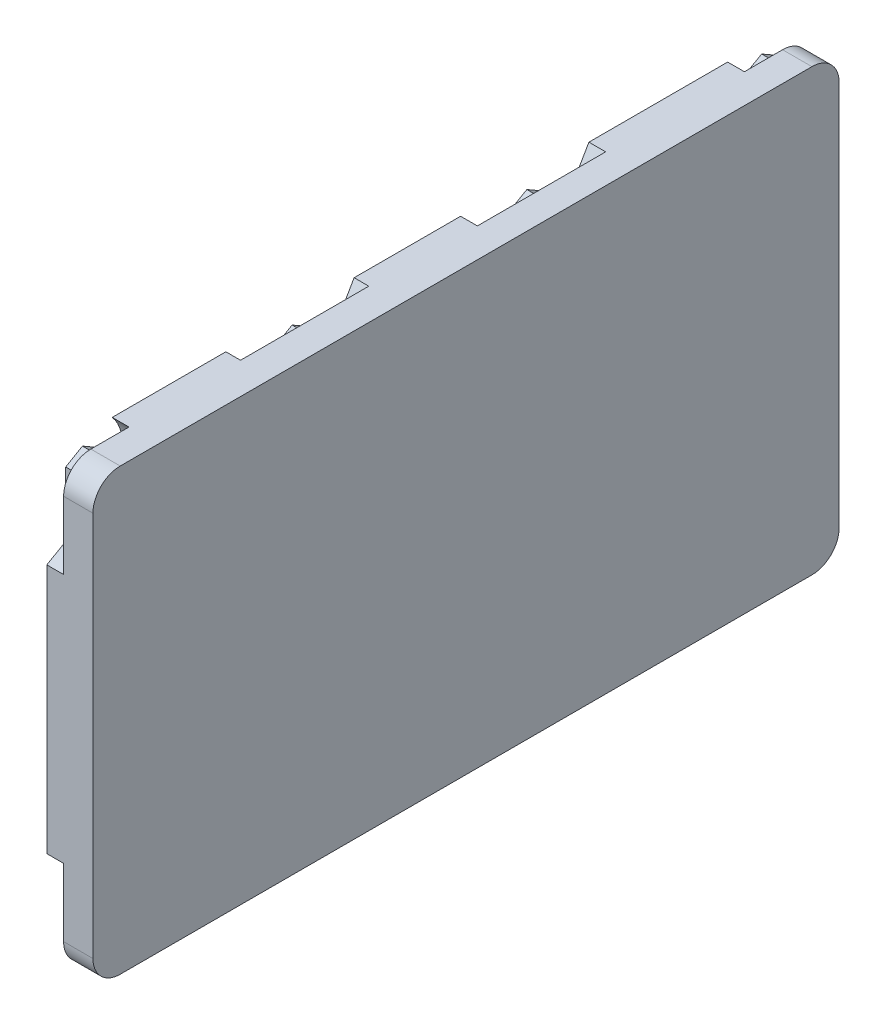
ISO-10303-21;
HEADER;
FILE_DESCRIPTION(('STEP AP214'),'2;1');
FILE_NAME('part.step','',(''),(''),'','','');
FILE_SCHEMA(('AUTOMOTIVE_DESIGN { 1 0 10303 214 1 1 1 1 }'));
ENDSEC;
DATA;
#1=APPLICATION_CONTEXT('core data for automotive mechanical design processes');
#2=APPLICATION_PROTOCOL_DEFINITION('international standard','automotive_design',2000,#1);
#3=PRODUCT_CONTEXT('',#1,'mechanical');
#4=PRODUCT('Part','Part','',(#3));
#5=PRODUCT_RELATED_PRODUCT_CATEGORY('part','',(#4));
#6=PRODUCT_DEFINITION_FORMATION('','',#4);
#7=PRODUCT_DEFINITION_CONTEXT('part definition',#1,'design');
#8=PRODUCT_DEFINITION('design','',#6,#7);
#9=PRODUCT_DEFINITION_SHAPE('','',#8);
#10=(LENGTH_UNIT() NAMED_UNIT(*) SI_UNIT(.MILLI.,.METRE.));
#11=(NAMED_UNIT(*) PLANE_ANGLE_UNIT() SI_UNIT($,.RADIAN.));
#12=(NAMED_UNIT(*) SI_UNIT($,.STERADIAN.) SOLID_ANGLE_UNIT());
#13=UNCERTAINTY_MEASURE_WITH_UNIT(LENGTH_MEASURE(1.E-05),#10,'distance_accuracy_value','');
#14=(GEOMETRIC_REPRESENTATION_CONTEXT(3) GLOBAL_UNCERTAINTY_ASSIGNED_CONTEXT((#13)) GLOBAL_UNIT_ASSIGNED_CONTEXT((#10,
#11,#12)) REPRESENTATION_CONTEXT('',''));
#15=CARTESIAN_POINT('',(0.,0.,0.));
#16=DIRECTION('',(0.,0.,1.));
#17=DIRECTION('',(1.,0.,0.));
#18=AXIS2_PLACEMENT_3D('',#15,#16,#17);
#19=CARTESIAN_POINT('',(-93.5,130.190598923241,50.));
#20=DIRECTION('',(1.,0.,0.));
#21=DIRECTION('',(0.,0.,-1.));
#22=AXIS2_PLACEMENT_3D('',#19,#20,#21);
#23=PLANE('',#22);
#24=DIRECTION('',(0.,1.,0.));
#25=VECTOR('',#24,1.);
#26=CARTESIAN_POINT('',(-93.5,134.809401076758,50.));
#27=LINE('',#26,#25);
#28=CARTESIAN_POINT('',(-93.5,134.809401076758,50.0000000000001));
#29=VERTEX_POINT('',#28);
#30=CARTESIAN_POINT('',(-93.5,130.190598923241,50.));
#31=VERTEX_POINT('',#30);
#32=EDGE_CURVE('E1849',#29,#31,#27,.F.);
#33=ORIENTED_EDGE('',*,*,#32,.F.);
#34=DIRECTION('',(0.,-0.5,0.866025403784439));
#35=VECTOR('',#34,1.);
#36=CARTESIAN_POINT('',(-93.5,137.118802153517,46.));
#37=LINE('',#36,#35);
#38=CARTESIAN_POINT('',(-93.5,137.118802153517,46.0000000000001));
#39=VERTEX_POINT('',#38);
#40=EDGE_CURVE('E1854',#39,#29,#37,.T.);
#41=ORIENTED_EDGE('',*,*,#40,.F.);
#42=DIRECTION('',(0.,0.5,0.866025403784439));
#43=VECTOR('',#42,1.);
#44=CARTESIAN_POINT('',(-93.5,134.809401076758,42.));
#45=LINE('',#44,#43);
#46=CARTESIAN_POINT('',(-93.5,134.809401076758,42.));
#47=VERTEX_POINT('',#46);
#48=EDGE_CURVE('E1872',#47,#39,#45,.T.);
#49=ORIENTED_EDGE('',*,*,#48,.F.);
#50=DIRECTION('',(0.,1.,0.));
#51=VECTOR('',#50,1.);
#52=CARTESIAN_POINT('',(-93.5,130.190598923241,42.));
#53=LINE('',#52,#51);
#54=CARTESIAN_POINT('',(-93.5,130.190598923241,42.));
#55=VERTEX_POINT('',#54);
#56=EDGE_CURVE('E1880',#55,#47,#53,.T.);
#57=ORIENTED_EDGE('',*,*,#56,.F.);
#58=DIRECTION('',(0.,0.5,-0.866025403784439));
#59=VECTOR('',#58,1.);
#60=CARTESIAN_POINT('',(-93.5,127.881197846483,46.));
#61=LINE('',#60,#59);
#62=CARTESIAN_POINT('',(-93.5,127.881197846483,46.0000000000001));
#63=VERTEX_POINT('',#62);
#64=EDGE_CURVE('E1885',#63,#55,#61,.T.);
#65=ORIENTED_EDGE('',*,*,#64,.F.);
#66=DIRECTION('',(0.,-0.5,-0.866025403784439));
#67=VECTOR('',#66,1.);
#68=CARTESIAN_POINT('',(-93.5,130.190598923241,50.));
#69=LINE('',#68,#67);
#70=EDGE_CURVE('E1859',#31,#63,#69,.T.);
#71=ORIENTED_EDGE('',*,*,#70,.F.);
#72=EDGE_LOOP('',(#33,#41,#49,#57,#65,#71));
#73=FACE_BOUND('',#72,.T.);
#74=ADVANCED_FACE('F16',(#73),#23,.F.);
#75=CARTESIAN_POINT('',(-93.5,130.190598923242,-112.));
#76=DIRECTION('',(1.,0.,0.));
#77=DIRECTION('',(0.,0.,-1.));
#78=AXIS2_PLACEMENT_3D('',#75,#76,#77);
#79=PLANE('',#78);
#80=DIRECTION('',(0.,1.,0.));
#81=VECTOR('',#80,1.);
#82=CARTESIAN_POINT('',(-93.5,134.809401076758,-112.));
#83=LINE('',#82,#81);
#84=CARTESIAN_POINT('',(-93.5,134.809401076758,-112.));
#85=VERTEX_POINT('',#84);
#86=CARTESIAN_POINT('',(-93.5,130.190598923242,-112.));
#87=VERTEX_POINT('',#86);
#88=EDGE_CURVE('E1895',#85,#87,#83,.F.);
#89=ORIENTED_EDGE('',*,*,#88,.F.);
#90=DIRECTION('',(0.,-0.5,0.866025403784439));
#91=VECTOR('',#90,1.);
#92=CARTESIAN_POINT('',(-93.5,137.118802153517,-116.));
#93=LINE('',#92,#91);
#94=CARTESIAN_POINT('',(-93.5,137.118802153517,-116.));
#95=VERTEX_POINT('',#94);
#96=EDGE_CURVE('E1902',#95,#85,#93,.T.);
#97=ORIENTED_EDGE('',*,*,#96,.F.);
#98=DIRECTION('',(0.,0.5,0.866025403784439));
#99=VECTOR('',#98,1.);
#100=CARTESIAN_POINT('',(-93.5,134.809401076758,-120.));
#101=LINE('',#100,#99);
#102=CARTESIAN_POINT('',(-93.5,134.809401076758,-120.));
#103=VERTEX_POINT('',#102);
#104=EDGE_CURVE('E1906',#103,#95,#101,.T.);
#105=ORIENTED_EDGE('',*,*,#104,.F.);
#106=DIRECTION('',(0.,1.,0.));
#107=VECTOR('',#106,1.);
#108=CARTESIAN_POINT('',(-93.5,130.190598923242,-120.));
#109=LINE('',#108,#107);
#110=CARTESIAN_POINT('',(-93.5,130.190598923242,-120.));
#111=VERTEX_POINT('',#110);
#112=EDGE_CURVE('E1912',#111,#103,#109,.T.);
#113=ORIENTED_EDGE('',*,*,#112,.F.);
#114=DIRECTION('',(0.,0.5,-0.866025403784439));
#115=VECTOR('',#114,1.);
#116=CARTESIAN_POINT('',(-93.5,127.881197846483,-116.));
#117=LINE('',#116,#115);
#118=CARTESIAN_POINT('',(-93.5,127.881197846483,-116.));
#119=VERTEX_POINT('',#118);
#120=EDGE_CURVE('E1918',#119,#111,#117,.T.);
#121=ORIENTED_EDGE('',*,*,#120,.F.);
#122=DIRECTION('',(0.,-0.5,-0.866025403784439));
#123=VECTOR('',#122,1.);
#124=CARTESIAN_POINT('',(-93.5,130.190598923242,-112.));
#125=LINE('',#124,#123);
#126=EDGE_CURVE('E1924',#87,#119,#125,.T.);
#127=ORIENTED_EDGE('',*,*,#126,.F.);
#128=EDGE_LOOP('',(#89,#97,#105,#113,#121,#127));
#129=FACE_BOUND('',#128,.T.);
#130=ADVANCED_FACE('F1761',(#129),#79,.F.);
#131=CARTESIAN_POINT('',(-93.5,130.190598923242,-56.));
#132=DIRECTION('',(1.,0.,0.));
#133=DIRECTION('',(0.,0.,-1.));
#134=AXIS2_PLACEMENT_3D('',#131,#132,#133);
#135=PLANE('',#134);
#136=DIRECTION('',(0.,1.,0.));
#137=VECTOR('',#136,1.);
#138=CARTESIAN_POINT('',(-93.5,134.809401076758,-56.));
#139=LINE('',#138,#137);
#140=CARTESIAN_POINT('',(-93.5,134.809401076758,-56.));
#141=VERTEX_POINT('',#140);
#142=CARTESIAN_POINT('',(-93.5,130.190598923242,-56.));
#143=VERTEX_POINT('',#142);
#144=EDGE_CURVE('E1930',#141,#143,#139,.F.);
#145=ORIENTED_EDGE('',*,*,#144,.F.);
#146=DIRECTION('',(0.,-0.5,0.866025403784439));
#147=VECTOR('',#146,1.);
#148=CARTESIAN_POINT('',(-93.5,137.118802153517,-60.));
#149=LINE('',#148,#147);
#150=CARTESIAN_POINT('',(-93.5,137.118802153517,-59.9999999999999));
#151=VERTEX_POINT('',#150);
#152=EDGE_CURVE('E1938',#151,#141,#149,.T.);
#153=ORIENTED_EDGE('',*,*,#152,.F.);
#154=DIRECTION('',(0.,0.5,0.866025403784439));
#155=VECTOR('',#154,1.);
#156=CARTESIAN_POINT('',(-93.5,134.809401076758,-64.));
#157=LINE('',#156,#155);
#158=CARTESIAN_POINT('',(-93.5,134.809401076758,-64.));
#159=VERTEX_POINT('',#158);
#160=EDGE_CURVE('E1942',#159,#151,#157,.T.);
#161=ORIENTED_EDGE('',*,*,#160,.F.);
#162=DIRECTION('',(0.,1.,0.));
#163=VECTOR('',#162,1.);
#164=CARTESIAN_POINT('',(-93.5,130.190598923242,-64.));
#165=LINE('',#164,#163);
#166=CARTESIAN_POINT('',(-93.5,130.190598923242,-64.0000000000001));
#167=VERTEX_POINT('',#166);
#168=EDGE_CURVE('E1948',#167,#159,#165,.T.);
#169=ORIENTED_EDGE('',*,*,#168,.F.);
#170=DIRECTION('',(0.,0.5,-0.866025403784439));
#171=VECTOR('',#170,1.);
#172=CARTESIAN_POINT('',(-93.5,127.881197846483,-60.));
#173=LINE('',#172,#171);
#174=CARTESIAN_POINT('',(-93.5,127.881197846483,-60.0000000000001));
#175=VERTEX_POINT('',#174);
#176=EDGE_CURVE('E1954',#175,#167,#173,.T.);
#177=ORIENTED_EDGE('',*,*,#176,.F.);
#178=DIRECTION('',(0.,-0.5,-0.866025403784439));
#179=VECTOR('',#178,1.);
#180=CARTESIAN_POINT('',(-93.5,130.190598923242,-56.));
#181=LINE('',#180,#179);
#182=EDGE_CURVE('E1960',#143,#175,#181,.T.);
#183=ORIENTED_EDGE('',*,*,#182,.F.);
#184=EDGE_LOOP('',(#145,#153,#161,#169,#177,#183));
#185=FACE_BOUND('',#184,.T.);
#186=ADVANCED_FACE('F1752',(#185),#135,.F.);
#187=CARTESIAN_POINT('',(-93.5,130.190598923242,0.));
#188=DIRECTION('',(1.,0.,0.));
#189=DIRECTION('',(0.,0.,-1.));
#190=AXIS2_PLACEMENT_3D('',#187,#188,#189);
#191=PLANE('',#190);
#192=DIRECTION('',(0.,1.,0.));
#193=VECTOR('',#192,1.);
#194=CARTESIAN_POINT('',(-93.5,134.809401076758,0.));
#195=LINE('',#194,#193);
#196=CARTESIAN_POINT('',(-93.5,134.809401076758,0.));
#197=VERTEX_POINT('',#196);
#198=CARTESIAN_POINT('',(-93.5,130.190598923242,0.));
#199=VERTEX_POINT('',#198);
#200=EDGE_CURVE('E1966',#197,#199,#195,.F.);
#201=ORIENTED_EDGE('',*,*,#200,.F.);
#202=DIRECTION('',(0.,-0.5,0.866025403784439));
#203=VECTOR('',#202,1.);
#204=CARTESIAN_POINT('',(-93.5,137.118802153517,-4.));
#205=LINE('',#204,#203);
#206=CARTESIAN_POINT('',(-93.5,137.118802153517,-3.99999999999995));
#207=VERTEX_POINT('',#206);
#208=EDGE_CURVE('E1974',#207,#197,#205,.T.);
#209=ORIENTED_EDGE('',*,*,#208,.F.);
#210=DIRECTION('',(0.,0.5,0.866025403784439));
#211=VECTOR('',#210,1.);
#212=CARTESIAN_POINT('',(-93.5,134.809401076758,-8.));
#213=LINE('',#212,#211);
#214=CARTESIAN_POINT('',(-93.5,134.809401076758,-8.));
#215=VERTEX_POINT('',#214);
#216=EDGE_CURVE('E1978',#215,#207,#213,.T.);
#217=ORIENTED_EDGE('',*,*,#216,.F.);
#218=DIRECTION('',(0.,1.,0.));
#219=VECTOR('',#218,1.);
#220=CARTESIAN_POINT('',(-93.5,130.190598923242,-8.));
#221=LINE('',#220,#219);
#222=CARTESIAN_POINT('',(-93.5,130.190598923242,-8.00000000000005));
#223=VERTEX_POINT('',#222);
#224=EDGE_CURVE('E1984',#223,#215,#221,.T.);
#225=ORIENTED_EDGE('',*,*,#224,.F.);
#226=DIRECTION('',(0.,0.5,-0.866025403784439));
#227=VECTOR('',#226,1.);
#228=CARTESIAN_POINT('',(-93.5,127.881197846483,-4.));
#229=LINE('',#228,#227);
#230=CARTESIAN_POINT('',(-93.5,127.881197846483,-4.00000000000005));
#231=VERTEX_POINT('',#230);
#232=EDGE_CURVE('E1990',#231,#223,#229,.T.);
#233=ORIENTED_EDGE('',*,*,#232,.F.);
#234=DIRECTION('',(0.,-0.5,-0.866025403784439));
#235=VECTOR('',#234,1.);
#236=CARTESIAN_POINT('',(-93.5,130.190598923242,0.));
#237=LINE('',#236,#235);
#238=EDGE_CURVE('E2002',#199,#231,#237,.T.);
#239=ORIENTED_EDGE('',*,*,#238,.F.);
#240=EDGE_LOOP('',(#201,#209,#217,#225,#233,#239));
#241=FACE_BOUND('',#240,.T.);
#242=ADVANCED_FACE('F1743',(#241),#191,.F.);
#243=CARTESIAN_POINT('',(-90.,134.809401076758,50.));
#244=DIRECTION('',(0.,0.,1.));
#245=DIRECTION('',(1.,0.,0.));
#246=AXIS2_PLACEMENT_3D('',#243,#244,#245);
#247=PLANE('',#246);
#248=DIRECTION('',(0.,1.,0.));
#249=VECTOR('',#248,1.);
#250=CARTESIAN_POINT('',(-90.,132.5,50.));
#251=LINE('',#250,#249);
#252=CARTESIAN_POINT('',(-90.,130.190598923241,50.));
#253=VERTEX_POINT('',#252);
#254=CARTESIAN_POINT('',(-90.,134.809401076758,50.0000000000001));
#255=VERTEX_POINT('',#254);
#256=EDGE_CURVE('E1869',#253,#255,#251,.T.);
#257=ORIENTED_EDGE('',*,*,#256,.T.);
#258=DIRECTION('',(1.,0.,0.));
#259=VECTOR('',#258,1.);
#260=CARTESIAN_POINT('',(-90.,134.809401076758,50.0000000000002));
#261=LINE('',#260,#259);
#262=EDGE_CURVE('E1866',#29,#255,#261,.T.);
#263=ORIENTED_EDGE('',*,*,#262,.F.);
#264=ORIENTED_EDGE('',*,*,#32,.T.);
#265=DIRECTION('',(1.,0.,0.));
#266=VECTOR('',#265,1.);
#267=CARTESIAN_POINT('',(-90.,130.190598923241,50.));
#268=LINE('',#267,#266);
#269=EDGE_CURVE('E1893',#253,#31,#268,.F.);
#270=ORIENTED_EDGE('',*,*,#269,.F.);
#271=EDGE_LOOP('',(#257,#263,#264,#270));
#272=FACE_BOUND('',#271,.T.);
#273=ADVANCED_FACE('F1734',(#272),#247,.T.);
#274=CARTESIAN_POINT('',(-90.,137.118802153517,46.));
#275=DIRECTION('',(0.,0.866025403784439,0.5));
#276=DIRECTION('',(0.,-0.5,0.866025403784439));
#277=AXIS2_PLACEMENT_3D('',#274,#275,#276);
#278=PLANE('',#277);
#279=DIRECTION('',(0.,0.500000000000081,-0.866025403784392));
#280=VECTOR('',#279,1.);
#281=CARTESIAN_POINT('',(-90.,134.809401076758,50.));
#282=LINE('',#281,#280);
#283=CARTESIAN_POINT('',(-90.,137.118802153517,46.0000000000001));
#284=VERTEX_POINT('',#283);
#285=EDGE_CURVE('E2020',#255,#284,#282,.T.);
#286=ORIENTED_EDGE('',*,*,#285,.T.);
#287=DIRECTION('',(1.,0.,0.));
#288=VECTOR('',#287,1.);
#289=CARTESIAN_POINT('',(-90.,137.118802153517,46.0000000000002));
#290=LINE('',#289,#288);
#291=EDGE_CURVE('E1875',#39,#284,#290,.T.);
#292=ORIENTED_EDGE('',*,*,#291,.F.);
#293=ORIENTED_EDGE('',*,*,#40,.T.);
#294=ORIENTED_EDGE('',*,*,#262,.T.);
#295=EDGE_LOOP('',(#286,#292,#293,#294));
#296=FACE_BOUND('',#295,.T.);
#297=ADVANCED_FACE('F1725',(#296),#278,.T.);
#298=CARTESIAN_POINT('',(-90.,134.809401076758,42.));
#299=DIRECTION('',(0.,0.866025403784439,-0.5));
#300=DIRECTION('',(0.,0.5,0.866025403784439));
#301=AXIS2_PLACEMENT_3D('',#298,#299,#300);
#302=PLANE('',#301);
#303=DIRECTION('',(0.,-0.500000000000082,-0.866025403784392));
#304=VECTOR('',#303,1.);
#305=CARTESIAN_POINT('',(-90.,137.118802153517,46.));
#306=LINE('',#305,#304);
#307=CARTESIAN_POINT('',(-90.,134.809401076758,42.));
#308=VERTEX_POINT('',#307);
#309=EDGE_CURVE('E2017',#284,#308,#306,.T.);
#310=ORIENTED_EDGE('',*,*,#309,.T.);
#311=DIRECTION('',(-1.,0.,0.));
#312=VECTOR('',#311,1.);
#313=CARTESIAN_POINT('',(-90.,134.809401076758,42.));
#314=LINE('',#313,#312);
#315=EDGE_CURVE('E1882',#47,#308,#314,.F.);
#316=ORIENTED_EDGE('',*,*,#315,.F.);
#317=ORIENTED_EDGE('',*,*,#48,.T.);
#318=ORIENTED_EDGE('',*,*,#291,.T.);
#319=EDGE_LOOP('',(#310,#316,#317,#318));
#320=FACE_BOUND('',#319,.T.);
#321=ADVANCED_FACE('F1716',(#320),#302,.T.);
#322=CARTESIAN_POINT('',(-90.,130.190598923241,42.));
#323=DIRECTION('',(0.,0.,-1.));
#324=DIRECTION('',(-1.,0.,0.));
#325=AXIS2_PLACEMENT_3D('',#322,#323,#324);
#326=PLANE('',#325);
#327=DIRECTION('',(0.,1.,0.));
#328=VECTOR('',#327,1.);
#329=CARTESIAN_POINT('',(-90.,132.5,42.));
#330=LINE('',#329,#328);
#331=CARTESIAN_POINT('',(-90.,130.190598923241,42.));
#332=VERTEX_POINT('',#331);
#333=EDGE_CURVE('E2014',#308,#332,#330,.F.);
#334=ORIENTED_EDGE('',*,*,#333,.T.);
#335=DIRECTION('',(1.,0.,0.));
#336=VECTOR('',#335,1.);
#337=CARTESIAN_POINT('',(-90.,130.190598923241,42.0000000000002));
#338=LINE('',#337,#336);
#339=EDGE_CURVE('E1888',#55,#332,#338,.T.);
#340=ORIENTED_EDGE('',*,*,#339,.F.);
#341=ORIENTED_EDGE('',*,*,#56,.T.);
#342=ORIENTED_EDGE('',*,*,#315,.T.);
#343=EDGE_LOOP('',(#334,#340,#341,#342));
#344=FACE_BOUND('',#343,.T.);
#345=ADVANCED_FACE('F1707',(#344),#326,.T.);
#346=CARTESIAN_POINT('',(-90.,127.881197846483,46.));
#347=DIRECTION('',(0.,-0.866025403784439,-0.5));
#348=DIRECTION('',(0.,0.5,-0.866025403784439));
#349=AXIS2_PLACEMENT_3D('',#346,#347,#348);
#350=PLANE('',#349);
#351=DIRECTION('',(0.,-0.49999999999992,0.866025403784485));
#352=VECTOR('',#351,1.);
#353=CARTESIAN_POINT('',(-90.,130.190598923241,42.));
#354=LINE('',#353,#352);
#355=CARTESIAN_POINT('',(-90.,127.881197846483,46.0000000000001));
#356=VERTEX_POINT('',#355);
#357=EDGE_CURVE('E2011',#332,#356,#354,.T.);
#358=ORIENTED_EDGE('',*,*,#357,.T.);
#359=DIRECTION('',(1.,0.,0.));
#360=VECTOR('',#359,1.);
#361=CARTESIAN_POINT('',(-90.,127.881197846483,46.0000000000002));
#362=LINE('',#361,#360);
#363=EDGE_CURVE('E1896',#63,#356,#362,.T.);
#364=ORIENTED_EDGE('',*,*,#363,.F.);
#365=ORIENTED_EDGE('',*,*,#64,.T.);
#366=ORIENTED_EDGE('',*,*,#339,.T.);
#367=EDGE_LOOP('',(#358,#364,#365,#366));
#368=FACE_BOUND('',#367,.T.);
#369=ADVANCED_FACE('F1698',(#368),#350,.T.);
#370=CARTESIAN_POINT('',(-90.,130.190598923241,50.));
#371=DIRECTION('',(0.,-0.866025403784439,0.5));
#372=DIRECTION('',(0.,-0.5,-0.866025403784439));
#373=AXIS2_PLACEMENT_3D('',#370,#371,#372);
#374=PLANE('',#373);
#375=DIRECTION('',(0.,0.499999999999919,0.866025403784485));
#376=VECTOR('',#375,1.);
#377=CARTESIAN_POINT('',(-90.,127.881197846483,46.));
#378=LINE('',#377,#376);
#379=EDGE_CURVE('E2007',#356,#253,#378,.T.);
#380=ORIENTED_EDGE('',*,*,#379,.T.);
#381=ORIENTED_EDGE('',*,*,#269,.T.);
#382=ORIENTED_EDGE('',*,*,#70,.T.);
#383=ORIENTED_EDGE('',*,*,#363,.T.);
#384=EDGE_LOOP('',(#380,#381,#382,#383));
#385=FACE_BOUND('',#384,.T.);
#386=ADVANCED_FACE('F1689',(#385),#374,.T.);
#387=CARTESIAN_POINT('',(-90.,134.809401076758,-112.));
#388=DIRECTION('',(0.,0.,1.));
#389=DIRECTION('',(1.,0.,0.));
#390=AXIS2_PLACEMENT_3D('',#387,#388,#389);
#391=PLANE('',#390);
#392=DIRECTION('',(0.,1.,0.));
#393=VECTOR('',#392,1.);
#394=CARTESIAN_POINT('',(-90.,132.5,-112.));
#395=LINE('',#394,#393);
#396=CARTESIAN_POINT('',(-90.,130.190598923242,-112.));
#397=VERTEX_POINT('',#396);
#398=CARTESIAN_POINT('',(-90.,134.809401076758,-112.));
#399=VERTEX_POINT('',#398);
#400=EDGE_CURVE('E2010',#397,#399,#395,.T.);
#401=ORIENTED_EDGE('',*,*,#400,.T.);
#402=DIRECTION('',(1.,0.,0.));
#403=VECTOR('',#402,1.);
#404=CARTESIAN_POINT('',(-90.,134.809401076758,-112.));
#405=LINE('',#404,#403);
#406=EDGE_CURVE('E1903',#85,#399,#405,.T.);
#407=ORIENTED_EDGE('',*,*,#406,.F.);
#408=ORIENTED_EDGE('',*,*,#88,.T.);
#409=DIRECTION('',(1.,0.,0.));
#410=VECTOR('',#409,1.);
#411=CARTESIAN_POINT('',(-90.,130.190598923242,-112.));
#412=LINE('',#411,#410);
#413=EDGE_CURVE('E1927',#397,#87,#412,.F.);
#414=ORIENTED_EDGE('',*,*,#413,.F.);
#415=EDGE_LOOP('',(#401,#407,#408,#414));
#416=FACE_BOUND('',#415,.T.);
#417=ADVANCED_FACE('F1680',(#416),#391,.T.);
#418=CARTESIAN_POINT('',(-90.,137.118802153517,-116.));
#419=DIRECTION('',(0.,0.866025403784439,0.5));
#420=DIRECTION('',(0.,-0.5,0.866025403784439));
#421=AXIS2_PLACEMENT_3D('',#418,#419,#420);
#422=PLANE('',#421);
#423=DIRECTION('',(0.,0.500000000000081,-0.866025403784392));
#424=VECTOR('',#423,1.);
#425=CARTESIAN_POINT('',(-90.,134.809401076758,-112.));
#426=LINE('',#425,#424);
#427=CARTESIAN_POINT('',(-90.,137.118802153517,-116.));
#428=VERTEX_POINT('',#427);
#429=EDGE_CURVE('E2036',#399,#428,#426,.T.);
#430=ORIENTED_EDGE('',*,*,#429,.T.);
#431=DIRECTION('',(1.,0.,0.));
#432=VECTOR('',#431,1.);
#433=CARTESIAN_POINT('',(-90.,137.118802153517,-116.));
#434=LINE('',#433,#432);
#435=EDGE_CURVE('E1909',#95,#428,#434,.T.);
#436=ORIENTED_EDGE('',*,*,#435,.F.);
#437=ORIENTED_EDGE('',*,*,#96,.T.);
#438=ORIENTED_EDGE('',*,*,#406,.T.);
#439=EDGE_LOOP('',(#430,#436,#437,#438));
#440=FACE_BOUND('',#439,.T.);
#441=ADVANCED_FACE('F1671',(#440),#422,.T.);
#442=CARTESIAN_POINT('',(-90.,134.809401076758,-120.));
#443=DIRECTION('',(0.,0.866025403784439,-0.5));
#444=DIRECTION('',(0.,0.5,0.866025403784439));
#445=AXIS2_PLACEMENT_3D('',#442,#443,#444);
#446=PLANE('',#445);
#447=DIRECTION('',(0.,-0.500000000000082,-0.866025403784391));
#448=VECTOR('',#447,1.);
#449=CARTESIAN_POINT('',(-90.,137.118802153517,-116.));
#450=LINE('',#449,#448);
#451=CARTESIAN_POINT('',(-90.,134.809401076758,-120.));
#452=VERTEX_POINT('',#451);
#453=EDGE_CURVE('E2033',#428,#452,#450,.T.);
#454=ORIENTED_EDGE('',*,*,#453,.T.);
#455=DIRECTION('',(-1.,0.,0.));
#456=VECTOR('',#455,1.);
#457=CARTESIAN_POINT('',(-90.,134.809401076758,-120.));
#458=LINE('',#457,#456);
#459=EDGE_CURVE('E1915',#103,#452,#458,.F.);
#460=ORIENTED_EDGE('',*,*,#459,.F.);
#461=ORIENTED_EDGE('',*,*,#104,.T.);
#462=ORIENTED_EDGE('',*,*,#435,.T.);
#463=EDGE_LOOP('',(#454,#460,#461,#462));
#464=FACE_BOUND('',#463,.T.);
#465=ADVANCED_FACE('F1662',(#464),#446,.T.);
#466=CARTESIAN_POINT('',(-90.,130.190598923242,-120.));
#467=DIRECTION('',(0.,0.,-1.));
#468=DIRECTION('',(-1.,0.,0.));
#469=AXIS2_PLACEMENT_3D('',#466,#467,#468);
#470=PLANE('',#469);
#471=DIRECTION('',(0.,1.,0.));
#472=VECTOR('',#471,1.);
#473=CARTESIAN_POINT('',(-90.,132.5,-120.));
#474=LINE('',#473,#472);
#475=CARTESIAN_POINT('',(-90.,130.190598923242,-120.));
#476=VERTEX_POINT('',#475);
#477=EDGE_CURVE('E2030',#452,#476,#474,.F.);
#478=ORIENTED_EDGE('',*,*,#477,.T.);
#479=DIRECTION('',(1.,0.,0.));
#480=VECTOR('',#479,1.);
#481=CARTESIAN_POINT('',(-90.,130.190598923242,-120.));
#482=LINE('',#481,#480);
#483=EDGE_CURVE('E1921',#111,#476,#482,.T.);
#484=ORIENTED_EDGE('',*,*,#483,.F.);
#485=ORIENTED_EDGE('',*,*,#112,.T.);
#486=ORIENTED_EDGE('',*,*,#459,.T.);
#487=EDGE_LOOP('',(#478,#484,#485,#486));
#488=FACE_BOUND('',#487,.T.);
#489=ADVANCED_FACE('F1653',(#488),#470,.T.);
#490=CARTESIAN_POINT('',(-90.,127.881197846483,-116.));
#491=DIRECTION('',(0.,-0.866025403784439,-0.5));
#492=DIRECTION('',(0.,0.5,-0.866025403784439));
#493=AXIS2_PLACEMENT_3D('',#490,#491,#492);
#494=PLANE('',#493);
#495=DIRECTION('',(0.,-0.500000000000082,0.866025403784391));
#496=VECTOR('',#495,1.);
#497=CARTESIAN_POINT('',(-90.,130.190598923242,-120.));
#498=LINE('',#497,#496);
#499=CARTESIAN_POINT('',(-90.,127.881197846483,-116.));
#500=VERTEX_POINT('',#499);
#501=EDGE_CURVE('E2027',#476,#500,#498,.T.);
#502=ORIENTED_EDGE('',*,*,#501,.T.);
#503=DIRECTION('',(1.,0.,0.));
#504=VECTOR('',#503,1.);
#505=CARTESIAN_POINT('',(-90.,127.881197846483,-116.));
#506=LINE('',#505,#504);
#507=EDGE_CURVE('E1931',#119,#500,#506,.T.);
#508=ORIENTED_EDGE('',*,*,#507,.F.);
#509=ORIENTED_EDGE('',*,*,#120,.T.);
#510=ORIENTED_EDGE('',*,*,#483,.T.);
#511=EDGE_LOOP('',(#502,#508,#509,#510));
#512=FACE_BOUND('',#511,.T.);
#513=ADVANCED_FACE('F1644',(#512),#494,.T.);
#514=CARTESIAN_POINT('',(-90.,130.190598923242,-112.));
#515=DIRECTION('',(0.,-0.866025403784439,0.5));
#516=DIRECTION('',(0.,-0.5,-0.866025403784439));
#517=AXIS2_PLACEMENT_3D('',#514,#515,#516);
#518=PLANE('',#517);
#519=DIRECTION('',(0.,0.500000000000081,0.866025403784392));
#520=VECTOR('',#519,1.);
#521=CARTESIAN_POINT('',(-90.,127.881197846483,-116.));
#522=LINE('',#521,#520);
#523=EDGE_CURVE('E2023',#500,#397,#522,.T.);
#524=ORIENTED_EDGE('',*,*,#523,.T.);
#525=ORIENTED_EDGE('',*,*,#413,.T.);
#526=ORIENTED_EDGE('',*,*,#126,.T.);
#527=ORIENTED_EDGE('',*,*,#507,.T.);
#528=EDGE_LOOP('',(#524,#525,#526,#527));
#529=FACE_BOUND('',#528,.T.);
#530=ADVANCED_FACE('F1635',(#529),#518,.T.);
#531=CARTESIAN_POINT('',(-90.,134.809401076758,-56.));
#532=DIRECTION('',(0.,0.,1.));
#533=DIRECTION('',(1.,0.,0.));
#534=AXIS2_PLACEMENT_3D('',#531,#532,#533);
#535=PLANE('',#534);
#536=DIRECTION('',(0.,1.,0.));
#537=VECTOR('',#536,1.);
#538=CARTESIAN_POINT('',(-90.,131.1,-56.));
#539=LINE('',#538,#537);
#540=CARTESIAN_POINT('',(-90.,130.190598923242,-56.));
#541=VERTEX_POINT('',#540);
#542=CARTESIAN_POINT('',(-90.,134.809401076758,-56.));
#543=VERTEX_POINT('',#542);
#544=EDGE_CURVE('E2026',#541,#543,#539,.T.);
#545=ORIENTED_EDGE('',*,*,#544,.T.);
#546=DIRECTION('',(1.,0.,0.));
#547=VECTOR('',#546,1.);
#548=CARTESIAN_POINT('',(-90.,134.809401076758,-55.9999999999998));
#549=LINE('',#548,#547);
#550=EDGE_CURVE('E1939',#141,#543,#549,.T.);
#551=ORIENTED_EDGE('',*,*,#550,.F.);
#552=ORIENTED_EDGE('',*,*,#144,.T.);
#553=DIRECTION('',(1.,0.,0.));
#554=VECTOR('',#553,1.);
#555=CARTESIAN_POINT('',(-90.,130.190598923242,-56.));
#556=LINE('',#555,#554);
#557=EDGE_CURVE('E1963',#541,#143,#556,.F.);
#558=ORIENTED_EDGE('',*,*,#557,.F.);
#559=EDGE_LOOP('',(#545,#551,#552,#558));
#560=FACE_BOUND('',#559,.T.);
#561=ADVANCED_FACE('F1626',(#560),#535,.T.);
#562=CARTESIAN_POINT('',(-90.,137.118802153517,-60.));
#563=DIRECTION('',(0.,0.866025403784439,0.5));
#564=DIRECTION('',(0.,-0.5,0.866025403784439));
#565=AXIS2_PLACEMENT_3D('',#562,#563,#564);
#566=PLANE('',#565);
#567=DIRECTION('',(0.,0.500000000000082,-0.866025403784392));
#568=VECTOR('',#567,1.);
#569=CARTESIAN_POINT('',(-90.,134.809401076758,-56.));
#570=LINE('',#569,#568);
#571=CARTESIAN_POINT('',(-90.,137.118802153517,-59.9999999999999));
#572=VERTEX_POINT('',#571);
#573=EDGE_CURVE('E2054',#543,#572,#570,.T.);
#574=ORIENTED_EDGE('',*,*,#573,.T.);
#575=DIRECTION('',(1.,0.,0.));
#576=VECTOR('',#575,1.);
#577=CARTESIAN_POINT('',(-90.,137.118802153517,-59.9999999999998));
#578=LINE('',#577,#576);
#579=EDGE_CURVE('E1945',#151,#572,#578,.T.);
#580=ORIENTED_EDGE('',*,*,#579,.F.);
#581=ORIENTED_EDGE('',*,*,#152,.T.);
#582=ORIENTED_EDGE('',*,*,#550,.T.);
#583=EDGE_LOOP('',(#574,#580,#581,#582));
#584=FACE_BOUND('',#583,.T.);
#585=ADVANCED_FACE('F1617',(#584),#566,.T.);
#586=CARTESIAN_POINT('',(-90.,134.809401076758,-64.));
#587=DIRECTION('',(0.,0.866025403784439,-0.5));
#588=DIRECTION('',(0.,0.5,0.866025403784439));
#589=AXIS2_PLACEMENT_3D('',#586,#587,#588);
#590=PLANE('',#589);
#591=DIRECTION('',(0.,-0.500000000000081,-0.866025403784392));
#592=VECTOR('',#591,1.);
#593=CARTESIAN_POINT('',(-90.,137.118802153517,-60.));
#594=LINE('',#593,#592);
#595=CARTESIAN_POINT('',(-90.,134.809401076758,-64.));
#596=VERTEX_POINT('',#595);
#597=EDGE_CURVE('E2051',#572,#596,#594,.T.);
#598=ORIENTED_EDGE('',*,*,#597,.T.);
#599=DIRECTION('',(-1.,0.,0.));
#600=VECTOR('',#599,1.);
#601=CARTESIAN_POINT('',(-90.,134.809401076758,-64.));
#602=LINE('',#601,#600);
#603=EDGE_CURVE('E1951',#159,#596,#602,.F.);
#604=ORIENTED_EDGE('',*,*,#603,.F.);
#605=ORIENTED_EDGE('',*,*,#160,.T.);
#606=ORIENTED_EDGE('',*,*,#579,.T.);
#607=EDGE_LOOP('',(#598,#604,#605,#606));
#608=FACE_BOUND('',#607,.T.);
#609=ADVANCED_FACE('F1608',(#608),#590,.T.);
#610=CARTESIAN_POINT('',(-90.,130.190598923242,-64.));
#611=DIRECTION('',(0.,0.,-1.));
#612=DIRECTION('',(-1.,0.,0.));
#613=AXIS2_PLACEMENT_3D('',#610,#611,#612);
#614=PLANE('',#613);
#615=DIRECTION('',(0.,1.,0.));
#616=VECTOR('',#615,1.);
#617=CARTESIAN_POINT('',(-90.,131.1,-64.));
#618=LINE('',#617,#616);
#619=CARTESIAN_POINT('',(-90.,130.190598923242,-64.0000000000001));
#620=VERTEX_POINT('',#619);
#621=EDGE_CURVE('E2048',#596,#620,#618,.F.);
#622=ORIENTED_EDGE('',*,*,#621,.T.);
#623=DIRECTION('',(1.,0.,0.));
#624=VECTOR('',#623,1.);
#625=CARTESIAN_POINT('',(-90.,130.190598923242,-64.0000000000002));
#626=LINE('',#625,#624);
#627=EDGE_CURVE('E1957',#167,#620,#626,.T.);
#628=ORIENTED_EDGE('',*,*,#627,.F.);
#629=ORIENTED_EDGE('',*,*,#168,.T.);
#630=ORIENTED_EDGE('',*,*,#603,.T.);
#631=EDGE_LOOP('',(#622,#628,#629,#630));
#632=FACE_BOUND('',#631,.T.);
#633=ADVANCED_FACE('F1599',(#632),#614,.T.);
#634=CARTESIAN_POINT('',(-90.,127.881197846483,-60.));
#635=DIRECTION('',(0.,-0.866025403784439,-0.5));
#636=DIRECTION('',(0.,0.5,-0.866025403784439));
#637=AXIS2_PLACEMENT_3D('',#634,#635,#636);
#638=PLANE('',#637);
#639=DIRECTION('',(0.,-0.500000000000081,0.866025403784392));
#640=VECTOR('',#639,1.);
#641=CARTESIAN_POINT('',(-90.,130.190598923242,-64.));
#642=LINE('',#641,#640);
#643=CARTESIAN_POINT('',(-90.,127.881197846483,-60.0000000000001));
#644=VERTEX_POINT('',#643);
#645=EDGE_CURVE('E2045',#620,#644,#642,.T.);
#646=ORIENTED_EDGE('',*,*,#645,.T.);
#647=DIRECTION('',(1.,0.,0.));
#648=VECTOR('',#647,1.);
#649=CARTESIAN_POINT('',(-90.,127.881197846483,-60.0000000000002));
#650=LINE('',#649,#648);
#651=EDGE_CURVE('E1967',#175,#644,#650,.T.);
#652=ORIENTED_EDGE('',*,*,#651,.F.);
#653=ORIENTED_EDGE('',*,*,#176,.T.);
#654=ORIENTED_EDGE('',*,*,#627,.T.);
#655=EDGE_LOOP('',(#646,#652,#653,#654));
#656=FACE_BOUND('',#655,.T.);
#657=ADVANCED_FACE('F1590',(#656),#638,.T.);
#658=CARTESIAN_POINT('',(-90.,130.190598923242,-56.));
#659=DIRECTION('',(0.,-0.866025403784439,0.5));
#660=DIRECTION('',(0.,-0.5,-0.866025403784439));
#661=AXIS2_PLACEMENT_3D('',#658,#659,#660);
#662=PLANE('',#661);
#663=DIRECTION('',(0.,0.500000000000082,0.866025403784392));
#664=VECTOR('',#663,1.);
#665=CARTESIAN_POINT('',(-90.,127.881197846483,-60.));
#666=LINE('',#665,#664);
#667=EDGE_CURVE('E2041',#644,#541,#666,.T.);
#668=ORIENTED_EDGE('',*,*,#667,.T.);
#669=ORIENTED_EDGE('',*,*,#557,.T.);
#670=ORIENTED_EDGE('',*,*,#182,.T.);
#671=ORIENTED_EDGE('',*,*,#651,.T.);
#672=EDGE_LOOP('',(#668,#669,#670,#671));
#673=FACE_BOUND('',#672,.T.);
#674=ADVANCED_FACE('F1581',(#673),#662,.T.);
#675=CARTESIAN_POINT('',(-90.,134.809401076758,0.));
#676=DIRECTION('',(0.,0.,1.));
#677=DIRECTION('',(1.,0.,0.));
#678=AXIS2_PLACEMENT_3D('',#675,#676,#677);
#679=PLANE('',#678);
#680=ORIENTED_EDGE('',*,*,#200,.T.);
#681=DIRECTION('',(1.,0.,0.));
#682=VECTOR('',#681,1.);
#683=CARTESIAN_POINT('',(-90.,130.190598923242,0.));
#684=LINE('',#683,#682);
#685=CARTESIAN_POINT('',(-90.5,130.190598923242,0.));
#686=VERTEX_POINT('',#685);
#687=EDGE_CURVE('E1996',#686,#199,#684,.F.);
#688=ORIENTED_EDGE('',*,*,#687,.F.);
#689=DIRECTION('',(0.,1.,0.));
#690=VECTOR('',#689,1.);
#691=CARTESIAN_POINT('',(-90.5,131.1,0.));
#692=LINE('',#691,#690);
#693=CARTESIAN_POINT('',(-90.5,134.809401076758,0.));
#694=VERTEX_POINT('',#693);
#695=EDGE_CURVE('E2044',#686,#694,#692,.T.);
#696=ORIENTED_EDGE('',*,*,#695,.T.);
#697=DIRECTION('',(1.,0.,0.));
#698=VECTOR('',#697,1.);
#699=CARTESIAN_POINT('',(-90.,134.809401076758,2.13370987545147E-13));
#700=LINE('',#699,#698);
#701=EDGE_CURVE('E1975',#197,#694,#700,.T.);
#702=ORIENTED_EDGE('',*,*,#701,.F.);
#703=EDGE_LOOP('',(#680,#688,#696,#702));
#704=FACE_BOUND('',#703,.T.);
#705=ADVANCED_FACE('F1572',(#704),#679,.T.);
#706=CARTESIAN_POINT('',(-90.,137.118802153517,-4.));
#707=DIRECTION('',(0.,0.866025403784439,0.5));
#708=DIRECTION('',(0.,-0.5,0.866025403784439));
#709=AXIS2_PLACEMENT_3D('',#706,#707,#708);
#710=PLANE('',#709);
#711=ORIENTED_EDGE('',*,*,#208,.T.);
#712=ORIENTED_EDGE('',*,*,#701,.T.);
#713=DIRECTION('',(0.,0.500000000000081,-0.866025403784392));
#714=VECTOR('',#713,1.);
#715=CARTESIAN_POINT('',(-90.5,134.809401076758,0.));
#716=LINE('',#715,#714);
#717=CARTESIAN_POINT('',(-90.5,137.118802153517,-3.99999999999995));
#718=VERTEX_POINT('',#717);
#719=EDGE_CURVE('E2072',#694,#718,#716,.T.);
#720=ORIENTED_EDGE('',*,*,#719,.T.);
#721=DIRECTION('',(1.,0.,0.));
#722=VECTOR('',#721,1.);
#723=CARTESIAN_POINT('',(-90.,137.118802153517,-3.99999999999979));
#724=LINE('',#723,#722);
#725=EDGE_CURVE('E1981',#207,#718,#724,.T.);
#726=ORIENTED_EDGE('',*,*,#725,.F.);
#727=EDGE_LOOP('',(#711,#712,#720,#726));
#728=FACE_BOUND('',#727,.T.);
#729=ADVANCED_FACE('F1563',(#728),#710,.T.);
#730=CARTESIAN_POINT('',(-90.,134.809401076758,-8.));
#731=DIRECTION('',(0.,0.866025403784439,-0.5));
#732=DIRECTION('',(0.,0.5,0.866025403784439));
#733=AXIS2_PLACEMENT_3D('',#730,#731,#732);
#734=PLANE('',#733);
#735=ORIENTED_EDGE('',*,*,#216,.T.);
#736=ORIENTED_EDGE('',*,*,#725,.T.);
#737=DIRECTION('',(0.,-0.500000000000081,-0.866025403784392));
#738=VECTOR('',#737,1.);
#739=CARTESIAN_POINT('',(-90.5,137.118802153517,-4.));
#740=LINE('',#739,#738);
#741=CARTESIAN_POINT('',(-90.5,134.809401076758,-8.));
#742=VERTEX_POINT('',#741);
#743=EDGE_CURVE('E2069',#718,#742,#740,.T.);
#744=ORIENTED_EDGE('',*,*,#743,.T.);
#745=DIRECTION('',(-1.,0.,0.));
#746=VECTOR('',#745,1.);
#747=CARTESIAN_POINT('',(-90.,134.809401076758,-8.));
#748=LINE('',#747,#746);
#749=EDGE_CURVE('E1987',#215,#742,#748,.F.);
#750=ORIENTED_EDGE('',*,*,#749,.F.);
#751=EDGE_LOOP('',(#735,#736,#744,#750));
#752=FACE_BOUND('',#751,.T.);
#753=ADVANCED_FACE('F1554',(#752),#734,.T.);
#754=CARTESIAN_POINT('',(-90.,130.190598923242,-8.));
#755=DIRECTION('',(0.,0.,-1.));
#756=DIRECTION('',(-1.,0.,0.));
#757=AXIS2_PLACEMENT_3D('',#754,#755,#756);
#758=PLANE('',#757);
#759=ORIENTED_EDGE('',*,*,#224,.T.);
#760=ORIENTED_EDGE('',*,*,#749,.T.);
#761=DIRECTION('',(0.,1.,0.));
#762=VECTOR('',#761,1.);
#763=CARTESIAN_POINT('',(-90.5,131.1,-8.));
#764=LINE('',#763,#762);
#765=CARTESIAN_POINT('',(-90.5,130.190598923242,-8.00000000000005));
#766=VERTEX_POINT('',#765);
#767=EDGE_CURVE('E2066',#742,#766,#764,.F.);
#768=ORIENTED_EDGE('',*,*,#767,.T.);
#769=DIRECTION('',(1.,0.,0.));
#770=VECTOR('',#769,1.);
#771=CARTESIAN_POINT('',(-90.,130.190598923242,-8.00000000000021));
#772=LINE('',#771,#770);
#773=EDGE_CURVE('E1993',#223,#766,#772,.T.);
#774=ORIENTED_EDGE('',*,*,#773,.F.);
#775=EDGE_LOOP('',(#759,#760,#768,#774));
#776=FACE_BOUND('',#775,.T.);
#777=ADVANCED_FACE('F1545',(#776),#758,.T.);
#778=CARTESIAN_POINT('',(-90.,127.881197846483,-4.));
#779=DIRECTION('',(0.,-0.866025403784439,-0.5));
#780=DIRECTION('',(0.,0.5,-0.866025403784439));
#781=AXIS2_PLACEMENT_3D('',#778,#779,#780);
#782=PLANE('',#781);
#783=ORIENTED_EDGE('',*,*,#232,.T.);
#784=ORIENTED_EDGE('',*,*,#773,.T.);
#785=DIRECTION('',(0.,-0.500000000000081,0.866025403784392));
#786=VECTOR('',#785,1.);
#787=CARTESIAN_POINT('',(-90.5,130.190598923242,-8.));
#788=LINE('',#787,#786);
#789=CARTESIAN_POINT('',(-90.5,127.881197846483,-4.00000000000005));
#790=VERTEX_POINT('',#789);
#791=EDGE_CURVE('E2063',#766,#790,#788,.T.);
#792=ORIENTED_EDGE('',*,*,#791,.T.);
#793=DIRECTION('',(1.,0.,0.));
#794=VECTOR('',#793,1.);
#795=CARTESIAN_POINT('',(-90.,127.881197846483,-4.00000000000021));
#796=LINE('',#795,#794);
#797=EDGE_CURVE('E1999',#231,#790,#796,.T.);
#798=ORIENTED_EDGE('',*,*,#797,.F.);
#799=EDGE_LOOP('',(#783,#784,#792,#798));
#800=FACE_BOUND('',#799,.T.);
#801=ADVANCED_FACE('F1536',(#800),#782,.T.);
#802=CARTESIAN_POINT('',(-90.,130.190598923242,0.));
#803=DIRECTION('',(0.,-0.866025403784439,0.5));
#804=DIRECTION('',(0.,-0.5,-0.866025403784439));
#805=AXIS2_PLACEMENT_3D('',#802,#803,#804);
#806=PLANE('',#805);
#807=ORIENTED_EDGE('',*,*,#238,.T.);
#808=ORIENTED_EDGE('',*,*,#797,.T.);
#809=DIRECTION('',(0.,0.500000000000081,0.866025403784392));
#810=VECTOR('',#809,1.);
#811=CARTESIAN_POINT('',(-90.5,127.881197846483,-4.));
#812=LINE('',#811,#810);
#813=EDGE_CURVE('E2059',#790,#686,#812,.T.);
#814=ORIENTED_EDGE('',*,*,#813,.T.);
#815=ORIENTED_EDGE('',*,*,#687,.T.);
#816=EDGE_LOOP('',(#807,#808,#814,#815));
#817=FACE_BOUND('',#816,.T.);
#818=ADVANCED_FACE('F1527',(#817),#806,.T.);
#819=CARTESIAN_POINT('',(-93.5,38.1905989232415,-112.));
#820=DIRECTION('',(1.,0.,0.));
#821=DIRECTION('',(0.,0.,-1.));
#822=AXIS2_PLACEMENT_3D('',#819,#820,#821);
#823=PLANE('',#822);
#824=DIRECTION('',(0.,1.,0.));
#825=VECTOR('',#824,1.);
#826=CARTESIAN_POINT('',(-93.5,42.8094010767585,-112.));
#827=LINE('',#826,#825);
#828=CARTESIAN_POINT('',(-93.5,42.8094010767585,-112.));
#829=VERTEX_POINT('',#828);
#830=CARTESIAN_POINT('',(-93.5,38.1905989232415,-112.));
#831=VERTEX_POINT('',#830);
#832=EDGE_CURVE('E2062',#829,#831,#827,.F.);
#833=ORIENTED_EDGE('',*,*,#832,.F.);
#834=DIRECTION('',(0.,-0.5,0.866025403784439));
#835=VECTOR('',#834,1.);
#836=CARTESIAN_POINT('',(-93.5,45.118802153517,-116.));
#837=LINE('',#836,#835);
#838=CARTESIAN_POINT('',(-93.5,45.118802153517,-116.));
#839=VERTEX_POINT('',#838);
#840=EDGE_CURVE('E2079',#839,#829,#837,.T.);
#841=ORIENTED_EDGE('',*,*,#840,.F.);
#842=DIRECTION('',(0.,0.5,0.866025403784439));
#843=VECTOR('',#842,1.);
#844=CARTESIAN_POINT('',(-93.5,42.8094010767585,-120.));
#845=LINE('',#844,#843);
#846=CARTESIAN_POINT('',(-93.5,42.8094010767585,-120.));
#847=VERTEX_POINT('',#846);
#848=EDGE_CURVE('E2083',#847,#839,#845,.T.);
#849=ORIENTED_EDGE('',*,*,#848,.F.);
#850=DIRECTION('',(0.,1.,0.));
#851=VECTOR('',#850,1.);
#852=CARTESIAN_POINT('',(-93.5,38.1905989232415,-120.));
#853=LINE('',#852,#851);
#854=CARTESIAN_POINT('',(-93.5,38.1905989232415,-120.));
#855=VERTEX_POINT('',#854);
#856=EDGE_CURVE('E2089',#855,#847,#853,.T.);
#857=ORIENTED_EDGE('',*,*,#856,.F.);
#858=DIRECTION('',(0.,0.5,-0.866025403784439));
#859=VECTOR('',#858,1.);
#860=CARTESIAN_POINT('',(-93.5,35.881197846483,-116.));
#861=LINE('',#860,#859);
#862=CARTESIAN_POINT('',(-93.5,35.881197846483,-116.));
#863=VERTEX_POINT('',#862);
#864=EDGE_CURVE('E2095',#863,#855,#861,.T.);
#865=ORIENTED_EDGE('',*,*,#864,.F.);
#866=DIRECTION('',(0.,-0.5,-0.866025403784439));
#867=VECTOR('',#866,1.);
#868=CARTESIAN_POINT('',(-93.5,38.1905989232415,-112.));
#869=LINE('',#868,#867);
#870=EDGE_CURVE('E428',#831,#863,#869,.T.);
#871=ORIENTED_EDGE('',*,*,#870,.F.);
#872=EDGE_LOOP('',(#833,#841,#849,#857,#865,#871));
#873=FACE_BOUND('',#872,.T.);
#874=ADVANCED_FACE('F1518',(#873),#823,.F.);
#875=CARTESIAN_POINT('',(-93.5,38.1905989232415,50.));
#876=DIRECTION('',(1.,0.,0.));
#877=DIRECTION('',(0.,0.,-1.));
#878=AXIS2_PLACEMENT_3D('',#875,#876,#877);
#879=PLANE('',#878);
#880=DIRECTION('',(0.,1.,0.));
#881=VECTOR('',#880,1.);
#882=CARTESIAN_POINT('',(-93.5,42.8094010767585,50.));
#883=LINE('',#882,#881);
#884=CARTESIAN_POINT('',(-93.5,42.8094010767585,50.));
#885=VERTEX_POINT('',#884);
#886=CARTESIAN_POINT('',(-93.5,38.1905989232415,50.));
#887=VERTEX_POINT('',#886);
#888=EDGE_CURVE('E410',#885,#887,#883,.F.);
#889=ORIENTED_EDGE('',*,*,#888,.F.);
#890=DIRECTION('',(0.,-0.5,0.866025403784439));
#891=VECTOR('',#890,1.);
#892=CARTESIAN_POINT('',(-93.5,45.118802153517,46.));
#893=LINE('',#892,#891);
#894=CARTESIAN_POINT('',(-93.5,45.118802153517,46.));
#895=VERTEX_POINT('',#894);
#896=EDGE_CURVE('E415',#895,#885,#893,.T.);
#897=ORIENTED_EDGE('',*,*,#896,.F.);
#898=DIRECTION('',(0.,0.5,0.866025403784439));
#899=VECTOR('',#898,1.);
#900=CARTESIAN_POINT('',(-93.5,42.8094010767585,42.));
#901=LINE('',#900,#899);
#902=CARTESIAN_POINT('',(-93.5,42.8094010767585,42.));
#903=VERTEX_POINT('',#902);
#904=EDGE_CURVE('E431',#903,#895,#901,.T.);
#905=ORIENTED_EDGE('',*,*,#904,.F.);
#906=DIRECTION('',(0.,1.,0.));
#907=VECTOR('',#906,1.);
#908=CARTESIAN_POINT('',(-93.5,38.1905989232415,42.));
#909=LINE('',#908,#907);
#910=CARTESIAN_POINT('',(-93.5,38.1905989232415,42.));
#911=VERTEX_POINT('',#910);
#912=EDGE_CURVE('E436',#911,#903,#909,.T.);
#913=ORIENTED_EDGE('',*,*,#912,.F.);
#914=DIRECTION('',(0.,0.5,-0.866025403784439));
#915=VECTOR('',#914,1.);
#916=CARTESIAN_POINT('',(-93.5,35.881197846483,46.));
#917=LINE('',#916,#915);
#918=CARTESIAN_POINT('',(-93.5,35.881197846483,46.));
#919=VERTEX_POINT('',#918);
#920=EDGE_CURVE('E442',#919,#911,#917,.T.);
#921=ORIENTED_EDGE('',*,*,#920,.F.);
#922=DIRECTION('',(0.,-0.5,-0.866025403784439));
#923=VECTOR('',#922,1.);
#924=CARTESIAN_POINT('',(-93.5,38.1905989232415,50.));
#925=LINE('',#924,#923);
#926=EDGE_CURVE('E448',#887,#919,#925,.T.);
#927=ORIENTED_EDGE('',*,*,#926,.F.);
#928=EDGE_LOOP('',(#889,#897,#905,#913,#921,#927));
#929=FACE_BOUND('',#928,.T.);
#930=ADVANCED_FACE('F1509',(#929),#879,.F.);
#931=CARTESIAN_POINT('',(-93.5,38.1905989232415,0.));
#932=DIRECTION('',(1.,0.,0.));
#933=DIRECTION('',(0.,0.,-1.));
#934=AXIS2_PLACEMENT_3D('',#931,#932,#933);
#935=PLANE('',#934);
#936=DIRECTION('',(0.,1.,0.));
#937=VECTOR('',#936,1.);
#938=CARTESIAN_POINT('',(-93.5,42.8094010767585,0.));
#939=LINE('',#938,#937);
#940=CARTESIAN_POINT('',(-93.5,42.8094010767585,0.));
#941=VERTEX_POINT('',#940);
#942=CARTESIAN_POINT('',(-93.5,38.1905989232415,0.));
#943=VERTEX_POINT('',#942);
#944=EDGE_CURVE('E453',#941,#943,#939,.F.);
#945=ORIENTED_EDGE('',*,*,#944,.F.);
#946=DIRECTION('',(0.,-0.5,0.866025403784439));
#947=VECTOR('',#946,1.);
#948=CARTESIAN_POINT('',(-93.5,45.118802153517,-4.));
#949=LINE('',#948,#947);
#950=CARTESIAN_POINT('',(-93.5,45.118802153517,-4.));
#951=VERTEX_POINT('',#950);
#952=EDGE_CURVE('E461',#951,#941,#949,.T.);
#953=ORIENTED_EDGE('',*,*,#952,.F.);
#954=DIRECTION('',(0.,0.5,0.866025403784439));
#955=VECTOR('',#954,1.);
#956=CARTESIAN_POINT('',(-93.5,42.8094010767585,-8.));
#957=LINE('',#956,#955);
#958=CARTESIAN_POINT('',(-93.5,42.8094010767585,-8.));
#959=VERTEX_POINT('',#958);
#960=EDGE_CURVE('E465',#959,#951,#957,.T.);
#961=ORIENTED_EDGE('',*,*,#960,.F.);
#962=DIRECTION('',(0.,1.,0.));
#963=VECTOR('',#962,1.);
#964=CARTESIAN_POINT('',(-93.5,38.1905989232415,-8.));
#965=LINE('',#964,#963);
#966=CARTESIAN_POINT('',(-93.5,38.1905989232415,-8.));
#967=VERTEX_POINT('',#966);
#968=EDGE_CURVE('E471',#967,#959,#965,.T.);
#969=ORIENTED_EDGE('',*,*,#968,.F.);
#970=DIRECTION('',(0.,0.5,-0.866025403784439));
#971=VECTOR('',#970,1.);
#972=CARTESIAN_POINT('',(-93.5,35.881197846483,-4.));
#973=LINE('',#972,#971);
#974=CARTESIAN_POINT('',(-93.5,35.881197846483,-4.));
#975=VERTEX_POINT('',#974);
#976=EDGE_CURVE('E477',#975,#967,#973,.T.);
#977=ORIENTED_EDGE('',*,*,#976,.F.);
#978=DIRECTION('',(0.,-0.5,-0.866025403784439));
#979=VECTOR('',#978,1.);
#980=CARTESIAN_POINT('',(-93.5,38.1905989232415,0.));
#981=LINE('',#980,#979);
#982=EDGE_CURVE('E483',#943,#975,#981,.T.);
#983=ORIENTED_EDGE('',*,*,#982,.F.);
#984=EDGE_LOOP('',(#945,#953,#961,#969,#977,#983));
#985=FACE_BOUND('',#984,.T.);
#986=ADVANCED_FACE('F1501',(#985),#935,.F.);
#987=CARTESIAN_POINT('',(-90.,132.5,45.2));
#988=DIRECTION('',(1.,0.,0.));
#989=DIRECTION('',(0.,0.,-1.));
#990=AXIS2_PLACEMENT_3D('',#987,#988,#989);
#991=PLANE('',#990);
#992=CARTESIAN_POINT('',(-90.,132.5,46.));
#993=DIRECTION('',(-1.,0.,0.));
#994=DIRECTION('',(0.,0.,1.));
#995=AXIS2_PLACEMENT_3D('',#992,#993,#994);
#996=CIRCLE('',#995,10.);
#997=CARTESIAN_POINT('',(-90.,139.,38.4006579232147));
#998=VERTEX_POINT('',#997);
#999=CARTESIAN_POINT('',(-90.,123.839745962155,40.9999999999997));
#1000=VERTEX_POINT('',#999);
#1001=EDGE_CURVE('E408',#998,#1000,#996,.T.);
#1002=ORIENTED_EDGE('',*,*,#1001,.T.);
#1003=DIRECTION('',(0.,0.5,-0.866025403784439));
#1004=VECTOR('',#1003,1.);
#1005=CARTESIAN_POINT('',(-90.,116.33419246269,54.));
#1006=LINE('',#1005,#1004);
#1007=CARTESIAN_POINT('',(-90.,116.33419246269,54.));
#1008=VERTEX_POINT('',#1007);
#1009=EDGE_CURVE('E320',#1000,#1008,#1006,.F.);
#1010=ORIENTED_EDGE('',*,*,#1009,.T.);
#1011=DIRECTION('',(0.,1.,0.));
#1012=VECTOR('',#1011,1.);
#1013=CARTESIAN_POINT('',(-90.,132.5,54.));
#1014=LINE('',#1013,#1012);
#1015=CARTESIAN_POINT('',(-90.,132.5,54.));
#1016=VERTEX_POINT('',#1015);
#1017=EDGE_CURVE('E281',#1016,#1008,#1014,.F.);
#1018=ORIENTED_EDGE('',*,*,#1017,.F.);
#1019=CARTESIAN_POINT('',(-90.,132.5,47.5));
#1020=DIRECTION('',(-1.,0.,0.));
#1021=DIRECTION('',(0.,0.,1.));
#1022=AXIS2_PLACEMENT_3D('',#1019,#1020,#1021);
#1023=CIRCLE('',#1022,6.50000000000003);
#1024=CARTESIAN_POINT('',(-90.,139.,47.5));
#1025=VERTEX_POINT('',#1024);
#1026=EDGE_CURVE('E20',#1025,#1016,#1023,.F.);
#1027=ORIENTED_EDGE('',*,*,#1026,.F.);
#1028=DIRECTION('',(0.,0.,1.));
#1029=VECTOR('',#1028,1.);
#1030=CARTESIAN_POINT('',(-90.,139.,-117.5));
#1031=LINE('',#1030,#1029);
#1032=EDGE_CURVE('E278',#998,#1025,#1031,.T.);
#1033=ORIENTED_EDGE('',*,*,#1032,.F.);
#1034=EDGE_LOOP('',(#1002,#1010,#1018,#1027,#1033));
#1035=FACE_BOUND('',#1034,.T.);
#1036=ORIENTED_EDGE('',*,*,#357,.F.);
#1037=ORIENTED_EDGE('',*,*,#333,.F.);
#1038=ORIENTED_EDGE('',*,*,#309,.F.);
#1039=ORIENTED_EDGE('',*,*,#285,.F.);
#1040=ORIENTED_EDGE('',*,*,#256,.F.);
#1041=ORIENTED_EDGE('',*,*,#379,.F.);
#1042=EDGE_LOOP('',(#1036,#1037,#1038,#1039,#1040,#1041));
#1043=FACE_BOUND('',#1042,.T.);
#1044=ADVANCED_FACE('F275',(#1035,#1043),#991,.F.);
#1045=CARTESIAN_POINT('',(-90.,132.5,-115.2));
#1046=DIRECTION('',(1.,0.,0.));
#1047=DIRECTION('',(0.,0.,-1.));
#1048=AXIS2_PLACEMENT_3D('',#1045,#1046,#1047);
#1049=PLANE('',#1048);
#1050=DIRECTION('',(0.,1.,0.));
#1051=VECTOR('',#1050,1.);
#1052=CARTESIAN_POINT('',(-90.,86.5,-124.));
#1053=LINE('',#1052,#1051);
#1054=CARTESIAN_POINT('',(-90.,116.33419246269,-124.));
#1055=VERTEX_POINT('',#1054);
#1056=CARTESIAN_POINT('',(-90.,132.5,-124.));
#1057=VERTEX_POINT('',#1056);
#1058=EDGE_CURVE('E313',#1055,#1057,#1053,.T.);
#1059=ORIENTED_EDGE('',*,*,#1058,.F.);
#1060=DIRECTION('',(0.,-0.5,-0.866025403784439));
#1061=VECTOR('',#1060,1.);
#1062=CARTESIAN_POINT('',(-90.,123.839745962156,-111.));
#1063=LINE('',#1062,#1061);
#1064=CARTESIAN_POINT('',(-90.,123.839745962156,-111.));
#1065=VERTEX_POINT('',#1064);
#1066=EDGE_CURVE('E307',#1055,#1065,#1063,.F.);
#1067=ORIENTED_EDGE('',*,*,#1066,.T.);
#1068=CARTESIAN_POINT('',(-90.,132.5,-116.));
#1069=DIRECTION('',(-1.,0.,0.));
#1070=DIRECTION('',(0.,0.,1.));
#1071=AXIS2_PLACEMENT_3D('',#1068,#1069,#1070);
#1072=CIRCLE('',#1071,10.);
#1073=CARTESIAN_POINT('',(-90.,139.,-108.400657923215));
#1074=VERTEX_POINT('',#1073);
#1075=EDGE_CURVE('E405',#1065,#1074,#1072,.T.);
#1076=ORIENTED_EDGE('',*,*,#1075,.T.);
#1077=DIRECTION('',(0.,0.,1.));
#1078=VECTOR('',#1077,1.);
#1079=CARTESIAN_POINT('',(-90.,139.,-117.5));
#1080=LINE('',#1079,#1078);
#1081=CARTESIAN_POINT('',(-90.,139.,-117.5));
#1082=VERTEX_POINT('',#1081);
#1083=EDGE_CURVE('E305',#1082,#1074,#1080,.T.);
#1084=ORIENTED_EDGE('',*,*,#1083,.F.);
#1085=CARTESIAN_POINT('',(-90.,132.5,-117.5));
#1086=DIRECTION('',(-1.,0.,0.));
#1087=DIRECTION('',(0.,0.,1.));
#1088=AXIS2_PLACEMENT_3D('',#1085,#1086,#1087);
#1089=CIRCLE('',#1088,6.50000000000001);
#1090=EDGE_CURVE('E284',#1057,#1082,#1089,.F.);
#1091=ORIENTED_EDGE('',*,*,#1090,.F.);
#1092=EDGE_LOOP('',(#1059,#1067,#1076,#1084,#1091));
#1093=FACE_BOUND('',#1092,.T.);
#1094=ORIENTED_EDGE('',*,*,#501,.F.);
#1095=ORIENTED_EDGE('',*,*,#477,.F.);
#1096=ORIENTED_EDGE('',*,*,#453,.F.);
#1097=ORIENTED_EDGE('',*,*,#429,.F.);
#1098=ORIENTED_EDGE('',*,*,#400,.F.);
#1099=ORIENTED_EDGE('',*,*,#523,.F.);
#1100=EDGE_LOOP('',(#1094,#1095,#1096,#1097,#1098,#1099));
#1101=FACE_BOUND('',#1100,.T.);
#1102=ADVANCED_FACE('F932',(#1093,#1101),#1049,.F.);
#1103=CARTESIAN_POINT('',(-90.,131.1,-60.));
#1104=DIRECTION('',(1.,0.,0.));
#1105=DIRECTION('',(0.,0.,-1.));
#1106=AXIS2_PLACEMENT_3D('',#1103,#1104,#1105);
#1107=PLANE('',#1106);
#1108=DIRECTION('',(0.,-0.866025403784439,-0.5));
#1109=VECTOR('',#1108,1.);
#1110=CARTESIAN_POINT('',(-90.,139.,-44.7002178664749));
#1111=LINE('',#1110,#1109);
#1112=CARTESIAN_POINT('',(-90.,127.5,-51.3397459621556));
#1113=VERTEX_POINT('',#1112);
#1114=CARTESIAN_POINT('',(-90.,139.,-44.7002178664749));
#1115=VERTEX_POINT('',#1114);
#1116=EDGE_CURVE('E301',#1113,#1115,#1111,.F.);
#1117=ORIENTED_EDGE('',*,*,#1116,.T.);
#1118=DIRECTION('',(0.,0.,1.));
#1119=VECTOR('',#1118,1.);
#1120=CARTESIAN_POINT('',(-90.,139.,-117.5));
#1121=LINE('',#1120,#1119);
#1122=CARTESIAN_POINT('',(-90.,139.,-75.2997821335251));
#1123=VERTEX_POINT('',#1122);
#1124=EDGE_CURVE('E770',#1123,#1115,#1121,.T.);
#1125=ORIENTED_EDGE('',*,*,#1124,.F.);
#1126=DIRECTION('',(0.,0.866025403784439,-0.5));
#1127=VECTOR('',#1126,1.);
#1128=CARTESIAN_POINT('',(-90.,127.5,-68.6602540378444));
#1129=LINE('',#1128,#1127);
#1130=CARTESIAN_POINT('',(-90.,127.5,-68.6602540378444));
#1131=VERTEX_POINT('',#1130);
#1132=EDGE_CURVE('E407',#1123,#1131,#1129,.F.);
#1133=ORIENTED_EDGE('',*,*,#1132,.T.);
#1134=CARTESIAN_POINT('',(-90.,132.5,-60.));
#1135=DIRECTION('',(-1.,0.,0.));
#1136=DIRECTION('',(0.,0.,1.));
#1137=AXIS2_PLACEMENT_3D('',#1134,#1135,#1136);
#1138=CIRCLE('',#1137,10.);
#1139=EDGE_CURVE('E401',#1131,#1113,#1138,.T.);
#1140=ORIENTED_EDGE('',*,*,#1139,.T.);
#1141=EDGE_LOOP('',(#1117,#1125,#1133,#1140));
#1142=FACE_BOUND('',#1141,.T.);
#1143=ORIENTED_EDGE('',*,*,#645,.F.);
#1144=ORIENTED_EDGE('',*,*,#621,.F.);
#1145=ORIENTED_EDGE('',*,*,#597,.F.);
#1146=ORIENTED_EDGE('',*,*,#573,.F.);
#1147=ORIENTED_EDGE('',*,*,#544,.F.);
#1148=ORIENTED_EDGE('',*,*,#667,.F.);
#1149=EDGE_LOOP('',(#1143,#1144,#1145,#1146,#1147,#1148));
#1150=FACE_BOUND('',#1149,.T.);
#1151=ADVANCED_FACE('F843',(#1142,#1150),#1107,.F.);
#1152=CARTESIAN_POINT('',(-90.5,131.1,-4.));
#1153=DIRECTION('',(1.,0.,0.));
#1154=DIRECTION('',(0.,0.,-1.));
#1155=AXIS2_PLACEMENT_3D('',#1152,#1153,#1154);
#1156=PLANE('',#1155);
#1157=DIRECTION('',(0.,-0.866025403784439,-0.5));
#1158=VECTOR('',#1157,1.);
#1159=CARTESIAN_POINT('',(-90.5,139.,11.2997821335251));
#1160=LINE('',#1159,#1158);
#1161=CARTESIAN_POINT('',(-90.5,127.5,4.6602540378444));
#1162=VERTEX_POINT('',#1161);
#1163=CARTESIAN_POINT('',(-90.5,139.,11.2997821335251));
#1164=VERTEX_POINT('',#1163);
#1165=EDGE_CURVE('E750',#1162,#1164,#1160,.F.);
#1166=ORIENTED_EDGE('',*,*,#1165,.T.);
#1167=DIRECTION('',(0.,0.,1.));
#1168=VECTOR('',#1167,1.);
#1169=CARTESIAN_POINT('',(-90.5,139.,-117.5));
#1170=LINE('',#1169,#1168);
#1171=CARTESIAN_POINT('',(-90.5,139.,-19.2997821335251));
#1172=VERTEX_POINT('',#1171);
#1173=EDGE_CURVE('E761',#1172,#1164,#1170,.T.);
#1174=ORIENTED_EDGE('',*,*,#1173,.F.);
#1175=DIRECTION('',(0.,0.866025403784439,-0.5));
#1176=VECTOR('',#1175,1.);
#1177=CARTESIAN_POINT('',(-90.5,127.5,-12.6602540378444));
#1178=LINE('',#1177,#1176);
#1179=CARTESIAN_POINT('',(-90.5,127.5,-12.6602540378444));
#1180=VERTEX_POINT('',#1179);
#1181=EDGE_CURVE('E758',#1172,#1180,#1178,.F.);
#1182=ORIENTED_EDGE('',*,*,#1181,.T.);
#1183=CARTESIAN_POINT('',(-90.5,132.5,-4.00000000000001));
#1184=DIRECTION('',(-1.,0.,0.));
#1185=DIRECTION('',(0.,0.,1.));
#1186=AXIS2_PLACEMENT_3D('',#1183,#1184,#1185);
#1187=CIRCLE('',#1186,10.);
#1188=EDGE_CURVE('E397',#1180,#1162,#1187,.T.);
#1189=ORIENTED_EDGE('',*,*,#1188,.T.);
#1190=EDGE_LOOP('',(#1166,#1174,#1182,#1189));
#1191=FACE_BOUND('',#1190,.T.);
#1192=ORIENTED_EDGE('',*,*,#791,.F.);
#1193=ORIENTED_EDGE('',*,*,#767,.F.);
#1194=ORIENTED_EDGE('',*,*,#743,.F.);
#1195=ORIENTED_EDGE('',*,*,#719,.F.);
#1196=ORIENTED_EDGE('',*,*,#695,.F.);
#1197=ORIENTED_EDGE('',*,*,#813,.F.);
#1198=EDGE_LOOP('',(#1192,#1193,#1194,#1195,#1196,#1197));
#1199=FACE_BOUND('',#1198,.T.);
#1200=ADVANCED_FACE('F875',(#1191,#1199),#1156,.F.);
#1201=CARTESIAN_POINT('',(-90.,42.8094010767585,-112.));
#1202=DIRECTION('',(0.,0.,1.));
#1203=DIRECTION('',(1.,0.,0.));
#1204=AXIS2_PLACEMENT_3D('',#1201,#1202,#1203);
#1205=PLANE('',#1204);
#1206=DIRECTION('',(0.,1.,0.));
#1207=VECTOR('',#1206,1.);
#1208=CARTESIAN_POINT('',(-90.,40.5,-112.));
#1209=LINE('',#1208,#1207);
#1210=CARTESIAN_POINT('',(-90.,38.1905989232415,-112.));
#1211=VERTEX_POINT('',#1210);
#1212=CARTESIAN_POINT('',(-90.,42.8094010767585,-112.));
#1213=VERTEX_POINT('',#1212);
#1214=EDGE_CURVE('E516',#1211,#1213,#1209,.T.);
#1215=ORIENTED_EDGE('',*,*,#1214,.T.);
#1216=DIRECTION('',(1.,0.,0.));
#1217=VECTOR('',#1216,1.);
#1218=CARTESIAN_POINT('',(-90.,42.8094010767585,-112.));
#1219=LINE('',#1218,#1217);
#1220=EDGE_CURVE('E2080',#829,#1213,#1219,.T.);
#1221=ORIENTED_EDGE('',*,*,#1220,.F.);
#1222=ORIENTED_EDGE('',*,*,#832,.T.);
#1223=DIRECTION('',(1.,0.,0.));
#1224=VECTOR('',#1223,1.);
#1225=CARTESIAN_POINT('',(-90.,38.1905989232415,-112.));
#1226=LINE('',#1225,#1224);
#1227=EDGE_CURVE('E285',#1211,#831,#1226,.F.);
#1228=ORIENTED_EDGE('',*,*,#1227,.F.);
#1229=EDGE_LOOP('',(#1215,#1221,#1222,#1228));
#1230=FACE_BOUND('',#1229,.T.);
#1231=ADVANCED_FACE('F1463',(#1230),#1205,.T.);
#1232=CARTESIAN_POINT('',(-90.,45.118802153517,-116.));
#1233=DIRECTION('',(0.,0.866025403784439,0.5));
#1234=DIRECTION('',(0.,-0.5,0.866025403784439));
#1235=AXIS2_PLACEMENT_3D('',#1232,#1233,#1234);
#1236=PLANE('',#1235);
#1237=DIRECTION('',(0.,0.5,-0.866025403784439));
#1238=VECTOR('',#1237,1.);
#1239=CARTESIAN_POINT('',(-90.,42.8094010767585,-112.));
#1240=LINE('',#1239,#1238);
#1241=CARTESIAN_POINT('',(-90.,45.118802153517,-116.));
#1242=VERTEX_POINT('',#1241);
#1243=EDGE_CURVE('E513',#1213,#1242,#1240,.T.);
#1244=ORIENTED_EDGE('',*,*,#1243,.T.);
#1245=DIRECTION('',(1.,0.,0.));
#1246=VECTOR('',#1245,1.);
#1247=CARTESIAN_POINT('',(-90.,45.118802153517,-116.));
#1248=LINE('',#1247,#1246);
#1249=EDGE_CURVE('E2086',#839,#1242,#1248,.T.);
#1250=ORIENTED_EDGE('',*,*,#1249,.F.);
#1251=ORIENTED_EDGE('',*,*,#840,.T.);
#1252=ORIENTED_EDGE('',*,*,#1220,.T.);
#1253=EDGE_LOOP('',(#1244,#1250,#1251,#1252));
#1254=FACE_BOUND('',#1253,.T.);
#1255=ADVANCED_FACE('F1454',(#1254),#1236,.T.);
#1256=CARTESIAN_POINT('',(-90.,42.8094010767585,-120.));
#1257=DIRECTION('',(0.,0.866025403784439,-0.5));
#1258=DIRECTION('',(0.,0.5,0.866025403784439));
#1259=AXIS2_PLACEMENT_3D('',#1256,#1257,#1258);
#1260=PLANE('',#1259);
#1261=DIRECTION('',(0.,-0.500000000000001,-0.866025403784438));
#1262=VECTOR('',#1261,1.);
#1263=CARTESIAN_POINT('',(-90.,45.118802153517,-116.));
#1264=LINE('',#1263,#1262);
#1265=CARTESIAN_POINT('',(-90.,42.8094010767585,-120.));
#1266=VERTEX_POINT('',#1265);
#1267=EDGE_CURVE('E510',#1242,#1266,#1264,.T.);
#1268=ORIENTED_EDGE('',*,*,#1267,.T.);
#1269=DIRECTION('',(-1.,0.,0.));
#1270=VECTOR('',#1269,1.);
#1271=CARTESIAN_POINT('',(-90.,42.8094010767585,-120.));
#1272=LINE('',#1271,#1270);
#1273=EDGE_CURVE('E2092',#847,#1266,#1272,.F.);
#1274=ORIENTED_EDGE('',*,*,#1273,.F.);
#1275=ORIENTED_EDGE('',*,*,#848,.T.);
#1276=ORIENTED_EDGE('',*,*,#1249,.T.);
#1277=EDGE_LOOP('',(#1268,#1274,#1275,#1276));
#1278=FACE_BOUND('',#1277,.T.);
#1279=ADVANCED_FACE('F1445',(#1278),#1260,.T.);
#1280=CARTESIAN_POINT('',(-90.,38.1905989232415,-120.));
#1281=DIRECTION('',(0.,0.,-1.));
#1282=DIRECTION('',(-1.,0.,0.));
#1283=AXIS2_PLACEMENT_3D('',#1280,#1281,#1282);
#1284=PLANE('',#1283);
#1285=DIRECTION('',(0.,1.,0.));
#1286=VECTOR('',#1285,1.);
#1287=CARTESIAN_POINT('',(-90.,40.5,-120.));
#1288=LINE('',#1287,#1286);
#1289=CARTESIAN_POINT('',(-90.,38.1905989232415,-120.));
#1290=VERTEX_POINT('',#1289);
#1291=EDGE_CURVE('E507',#1266,#1290,#1288,.F.);
#1292=ORIENTED_EDGE('',*,*,#1291,.T.);
#1293=DIRECTION('',(1.,0.,0.));
#1294=VECTOR('',#1293,1.);
#1295=CARTESIAN_POINT('',(-90.,38.1905989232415,-120.));
#1296=LINE('',#1295,#1294);
#1297=EDGE_CURVE('E2098',#855,#1290,#1296,.T.);
#1298=ORIENTED_EDGE('',*,*,#1297,.F.);
#1299=ORIENTED_EDGE('',*,*,#856,.T.);
#1300=ORIENTED_EDGE('',*,*,#1273,.T.);
#1301=EDGE_LOOP('',(#1292,#1298,#1299,#1300));
#1302=FACE_BOUND('',#1301,.T.);
#1303=ADVANCED_FACE('F1436',(#1302),#1284,.T.);
#1304=CARTESIAN_POINT('',(-90.,35.881197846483,-116.));
#1305=DIRECTION('',(0.,-0.866025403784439,-0.5));
#1306=DIRECTION('',(0.,0.5,-0.866025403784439));
#1307=AXIS2_PLACEMENT_3D('',#1304,#1305,#1306);
#1308=PLANE('',#1307);
#1309=DIRECTION('',(0.,-0.500000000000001,0.866025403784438));
#1310=VECTOR('',#1309,1.);
#1311=CARTESIAN_POINT('',(-90.,38.1905989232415,-120.));
#1312=LINE('',#1311,#1310);
#1313=CARTESIAN_POINT('',(-90.,35.881197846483,-116.));
#1314=VERTEX_POINT('',#1313);
#1315=EDGE_CURVE('E504',#1290,#1314,#1312,.T.);
#1316=ORIENTED_EDGE('',*,*,#1315,.T.);
#1317=DIRECTION('',(1.,0.,0.));
#1318=VECTOR('',#1317,1.);
#1319=CARTESIAN_POINT('',(-90.,35.881197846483,-116.));
#1320=LINE('',#1319,#1318);
#1321=EDGE_CURVE('E2104',#863,#1314,#1320,.T.);
#1322=ORIENTED_EDGE('',*,*,#1321,.F.);
#1323=ORIENTED_EDGE('',*,*,#864,.T.);
#1324=ORIENTED_EDGE('',*,*,#1297,.T.);
#1325=EDGE_LOOP('',(#1316,#1322,#1323,#1324));
#1326=FACE_BOUND('',#1325,.T.);
#1327=ADVANCED_FACE('F1427',(#1326),#1308,.T.);
#1328=CARTESIAN_POINT('',(-90.,38.1905989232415,-112.));
#1329=DIRECTION('',(0.,-0.866025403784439,0.5));
#1330=DIRECTION('',(0.,-0.5,-0.866025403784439));
#1331=AXIS2_PLACEMENT_3D('',#1328,#1329,#1330);
#1332=PLANE('',#1331);
#1333=DIRECTION('',(0.,0.5,0.866025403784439));
#1334=VECTOR('',#1333,1.);
#1335=CARTESIAN_POINT('',(-90.,35.881197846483,-116.));
#1336=LINE('',#1335,#1334);
#1337=EDGE_CURVE('E499',#1314,#1211,#1336,.T.);
#1338=ORIENTED_EDGE('',*,*,#1337,.T.);
#1339=ORIENTED_EDGE('',*,*,#1227,.T.);
#1340=ORIENTED_EDGE('',*,*,#870,.T.);
#1341=ORIENTED_EDGE('',*,*,#1321,.T.);
#1342=EDGE_LOOP('',(#1338,#1339,#1340,#1341));
#1343=FACE_BOUND('',#1342,.T.);
#1344=ADVANCED_FACE('F1419',(#1343),#1332,.T.);
#1345=CARTESIAN_POINT('',(-83.,132.5,47.5));
#1346=DIRECTION('',(-1.,0.,0.));
#1347=DIRECTION('',(0.,0.,1.));
#1348=AXIS2_PLACEMENT_3D('',#1345,#1346,#1347);
#1349=CYLINDRICAL_SURFACE('',#1348,6.50000000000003);
#1350=CARTESIAN_POINT('',(-83.,132.5,47.5));
#1351=DIRECTION('',(-1.,0.,0.));
#1352=DIRECTION('',(0.,0.,1.));
#1353=AXIS2_PLACEMENT_3D('',#1350,#1351,#1352);
#1354=CIRCLE('',#1353,6.50000000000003);
#1355=CARTESIAN_POINT('',(-83.,132.5,54.));
#1356=VERTEX_POINT('',#1355);
#1357=CARTESIAN_POINT('',(-83.,139.,47.5));
#1358=VERTEX_POINT('',#1357);
#1359=EDGE_CURVE('E290',#1356,#1358,#1354,.T.);
#1360=ORIENTED_EDGE('',*,*,#1359,.T.);
#1361=DIRECTION('',(1.,0.,0.));
#1362=VECTOR('',#1361,1.);
#1363=CARTESIAN_POINT('',(-83.,139.,47.5));
#1364=LINE('',#1363,#1362);
#1365=EDGE_CURVE('E287',#1025,#1358,#1364,.T.);
#1366=ORIENTED_EDGE('',*,*,#1365,.F.);
#1367=ORIENTED_EDGE('',*,*,#1026,.T.);
#1368=DIRECTION('',(1.,0.,0.));
#1369=VECTOR('',#1368,1.);
#1370=CARTESIAN_POINT('',(-83.,132.5,54.));
#1371=LINE('',#1370,#1369);
#1372=EDGE_CURVE('E322',#1356,#1016,#1371,.F.);
#1373=ORIENTED_EDGE('',*,*,#1372,.F.);
#1374=EDGE_LOOP('',(#1360,#1366,#1367,#1373));
#1375=FACE_BOUND('',#1374,.T.);
#1376=ADVANCED_FACE('F288',(#1375),#1349,.T.);
#1377=CARTESIAN_POINT('',(-83.,132.5,-117.5));
#1378=DIRECTION('',(-1.,0.,0.));
#1379=DIRECTION('',(0.,0.,1.));
#1380=AXIS2_PLACEMENT_3D('',#1377,#1378,#1379);
#1381=CYLINDRICAL_SURFACE('',#1380,6.50000000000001);
#1382=CARTESIAN_POINT('',(-83.,132.5,-117.5));
#1383=DIRECTION('',(-1.,0.,0.));
#1384=DIRECTION('',(0.,0.,1.));
#1385=AXIS2_PLACEMENT_3D('',#1382,#1383,#1384);
#1386=CIRCLE('',#1385,6.50000000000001);
#1387=CARTESIAN_POINT('',(-83.,139.,-117.5));
#1388=VERTEX_POINT('',#1387);
#1389=CARTESIAN_POINT('',(-83.,132.5,-124.));
#1390=VERTEX_POINT('',#1389);
#1391=EDGE_CURVE('E383',#1388,#1390,#1386,.T.);
#1392=ORIENTED_EDGE('',*,*,#1391,.T.);
#1393=DIRECTION('',(-1.,0.,0.));
#1394=VECTOR('',#1393,1.);
#1395=CARTESIAN_POINT('',(-83.,132.5,-124.));
#1396=LINE('',#1395,#1394);
#1397=EDGE_CURVE('E316',#1057,#1390,#1396,.F.);
#1398=ORIENTED_EDGE('',*,*,#1397,.F.);
#1399=ORIENTED_EDGE('',*,*,#1090,.T.);
#1400=DIRECTION('',(1.,0.,0.));
#1401=VECTOR('',#1400,1.);
#1402=CARTESIAN_POINT('',(-83.,139.,-117.5));
#1403=LINE('',#1402,#1401);
#1404=EDGE_CURVE('E294',#1388,#1082,#1403,.F.);
#1405=ORIENTED_EDGE('',*,*,#1404,.F.);
#1406=EDGE_LOOP('',(#1392,#1398,#1399,#1405));
#1407=FACE_BOUND('',#1406,.T.);
#1408=ADVANCED_FACE('F901',(#1407),#1381,.T.);
#1409=CARTESIAN_POINT('',(-90.,42.8094010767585,50.));
#1410=DIRECTION('',(0.,0.,1.));
#1411=DIRECTION('',(1.,0.,0.));
#1412=AXIS2_PLACEMENT_3D('',#1409,#1410,#1411);
#1413=PLANE('',#1412);
#1414=DIRECTION('',(0.,1.,0.));
#1415=VECTOR('',#1414,1.);
#1416=CARTESIAN_POINT('',(-90.,40.5,50.));
#1417=LINE('',#1416,#1415);
#1418=CARTESIAN_POINT('',(-90.,38.1905989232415,50.));
#1419=VERTEX_POINT('',#1418);
#1420=CARTESIAN_POINT('',(-90.,42.8094010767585,50.));
#1421=VERTEX_POINT('',#1420);
#1422=EDGE_CURVE('E548',#1419,#1421,#1417,.T.);
#1423=ORIENTED_EDGE('',*,*,#1422,.T.);
#1424=DIRECTION('',(1.,0.,0.));
#1425=VECTOR('',#1424,1.);
#1426=CARTESIAN_POINT('',(-90.,42.8094010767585,50.));
#1427=LINE('',#1426,#1425);
#1428=EDGE_CURVE('E424',#885,#1421,#1427,.T.);
#1429=ORIENTED_EDGE('',*,*,#1428,.F.);
#1430=ORIENTED_EDGE('',*,*,#888,.T.);
#1431=DIRECTION('',(1.,0.,0.));
#1432=VECTOR('',#1431,1.);
#1433=CARTESIAN_POINT('',(-90.,38.1905989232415,50.));
#1434=LINE('',#1433,#1432);
#1435=EDGE_CURVE('E451',#1419,#887,#1434,.F.);
#1436=ORIENTED_EDGE('',*,*,#1435,.F.);
#1437=EDGE_LOOP('',(#1423,#1429,#1430,#1436));
#1438=FACE_BOUND('',#1437,.T.);
#1439=ADVANCED_FACE('F1396',(#1438),#1413,.T.);
#1440=CARTESIAN_POINT('',(-90.,45.118802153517,46.));
#1441=DIRECTION('',(0.,0.866025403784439,0.5));
#1442=DIRECTION('',(0.,-0.5,0.866025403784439));
#1443=AXIS2_PLACEMENT_3D('',#1440,#1441,#1442);
#1444=PLANE('',#1443);
#1445=DIRECTION('',(0.,0.5,-0.866025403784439));
#1446=VECTOR('',#1445,1.);
#1447=CARTESIAN_POINT('',(-90.,42.8094010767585,50.));
#1448=LINE('',#1447,#1446);
#1449=CARTESIAN_POINT('',(-90.,45.118802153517,46.));
#1450=VERTEX_POINT('',#1449);
#1451=EDGE_CURVE('E545',#1421,#1450,#1448,.T.);
#1452=ORIENTED_EDGE('',*,*,#1451,.T.);
#1453=DIRECTION('',(1.,0.,0.));
#1454=VECTOR('',#1453,1.);
#1455=CARTESIAN_POINT('',(-90.,45.118802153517,46.));
#1456=LINE('',#1455,#1454);
#1457=EDGE_CURVE('E433',#895,#1450,#1456,.T.);
#1458=ORIENTED_EDGE('',*,*,#1457,.F.);
#1459=ORIENTED_EDGE('',*,*,#896,.T.);
#1460=ORIENTED_EDGE('',*,*,#1428,.T.);
#1461=EDGE_LOOP('',(#1452,#1458,#1459,#1460));
#1462=FACE_BOUND('',#1461,.T.);
#1463=ADVANCED_FACE('F1387',(#1462),#1444,.T.);
#1464=CARTESIAN_POINT('',(-90.,42.8094010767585,42.));
#1465=DIRECTION('',(0.,0.866025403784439,-0.5));
#1466=DIRECTION('',(0.,0.5,0.866025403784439));
#1467=AXIS2_PLACEMENT_3D('',#1464,#1465,#1466);
#1468=PLANE('',#1467);
#1469=DIRECTION('',(0.,-0.500000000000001,-0.866025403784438));
#1470=VECTOR('',#1469,1.);
#1471=CARTESIAN_POINT('',(-90.,45.118802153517,46.));
#1472=LINE('',#1471,#1470);
#1473=CARTESIAN_POINT('',(-90.,42.8094010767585,42.));
#1474=VERTEX_POINT('',#1473);
#1475=EDGE_CURVE('E542',#1450,#1474,#1472,.T.);
#1476=ORIENTED_EDGE('',*,*,#1475,.T.);
#1477=DIRECTION('',(-1.,0.,0.));
#1478=VECTOR('',#1477,1.);
#1479=CARTESIAN_POINT('',(-90.,42.8094010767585,42.));
#1480=LINE('',#1479,#1478);
#1481=EDGE_CURVE('E439',#903,#1474,#1480,.F.);
#1482=ORIENTED_EDGE('',*,*,#1481,.F.);
#1483=ORIENTED_EDGE('',*,*,#904,.T.);
#1484=ORIENTED_EDGE('',*,*,#1457,.T.);
#1485=EDGE_LOOP('',(#1476,#1482,#1483,#1484));
#1486=FACE_BOUND('',#1485,.T.);
#1487=ADVANCED_FACE('F1378',(#1486),#1468,.T.);
#1488=CARTESIAN_POINT('',(-90.,38.1905989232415,42.));
#1489=DIRECTION('',(0.,0.,-1.));
#1490=DIRECTION('',(-1.,0.,0.));
#1491=AXIS2_PLACEMENT_3D('',#1488,#1489,#1490);
#1492=PLANE('',#1491);
#1493=DIRECTION('',(0.,1.,0.));
#1494=VECTOR('',#1493,1.);
#1495=CARTESIAN_POINT('',(-90.,40.5,42.));
#1496=LINE('',#1495,#1494);
#1497=CARTESIAN_POINT('',(-90.,38.1905989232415,42.));
#1498=VERTEX_POINT('',#1497);
#1499=EDGE_CURVE('E539',#1474,#1498,#1496,.F.);
#1500=ORIENTED_EDGE('',*,*,#1499,.T.);
#1501=DIRECTION('',(1.,0.,0.));
#1502=VECTOR('',#1501,1.);
#1503=CARTESIAN_POINT('',(-90.,38.1905989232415,42.));
#1504=LINE('',#1503,#1502);
#1505=EDGE_CURVE('E445',#911,#1498,#1504,.T.);
#1506=ORIENTED_EDGE('',*,*,#1505,.F.);
#1507=ORIENTED_EDGE('',*,*,#912,.T.);
#1508=ORIENTED_EDGE('',*,*,#1481,.T.);
#1509=EDGE_LOOP('',(#1500,#1506,#1507,#1508));
#1510=FACE_BOUND('',#1509,.T.);
#1511=ADVANCED_FACE('F1369',(#1510),#1492,.T.);
#1512=CARTESIAN_POINT('',(-90.,35.881197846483,46.));
#1513=DIRECTION('',(0.,-0.866025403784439,-0.5));
#1514=DIRECTION('',(0.,0.5,-0.866025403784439));
#1515=AXIS2_PLACEMENT_3D('',#1512,#1513,#1514);
#1516=PLANE('',#1515);
#1517=DIRECTION('',(0.,-0.500000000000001,0.866025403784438));
#1518=VECTOR('',#1517,1.);
#1519=CARTESIAN_POINT('',(-90.,38.1905989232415,42.));
#1520=LINE('',#1519,#1518);
#1521=CARTESIAN_POINT('',(-90.,35.881197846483,46.));
#1522=VERTEX_POINT('',#1521);
#1523=EDGE_CURVE('E536',#1498,#1522,#1520,.T.);
#1524=ORIENTED_EDGE('',*,*,#1523,.T.);
#1525=DIRECTION('',(1.,0.,0.));
#1526=VECTOR('',#1525,1.);
#1527=CARTESIAN_POINT('',(-90.,35.881197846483,46.));
#1528=LINE('',#1527,#1526);
#1529=EDGE_CURVE('E454',#919,#1522,#1528,.T.);
#1530=ORIENTED_EDGE('',*,*,#1529,.F.);
#1531=ORIENTED_EDGE('',*,*,#920,.T.);
#1532=ORIENTED_EDGE('',*,*,#1505,.T.);
#1533=EDGE_LOOP('',(#1524,#1530,#1531,#1532));
#1534=FACE_BOUND('',#1533,.T.);
#1535=ADVANCED_FACE('F1360',(#1534),#1516,.T.);
#1536=CARTESIAN_POINT('',(-90.,38.1905989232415,50.));
#1537=DIRECTION('',(0.,-0.866025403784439,0.5));
#1538=DIRECTION('',(0.,-0.5,-0.866025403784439));
#1539=AXIS2_PLACEMENT_3D('',#1536,#1537,#1538);
#1540=PLANE('',#1539);
#1541=DIRECTION('',(0.,0.5,0.866025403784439));
#1542=VECTOR('',#1541,1.);
#1543=CARTESIAN_POINT('',(-90.,35.881197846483,46.));
#1544=LINE('',#1543,#1542);
#1545=EDGE_CURVE('E531',#1522,#1419,#1544,.T.);
#1546=ORIENTED_EDGE('',*,*,#1545,.T.);
#1547=ORIENTED_EDGE('',*,*,#1435,.T.);
#1548=ORIENTED_EDGE('',*,*,#926,.T.);
#1549=ORIENTED_EDGE('',*,*,#1529,.T.);
#1550=EDGE_LOOP('',(#1546,#1547,#1548,#1549));
#1551=FACE_BOUND('',#1550,.T.);
#1552=ADVANCED_FACE('F1351',(#1551),#1540,.T.);
#1553=CARTESIAN_POINT('',(-90.,42.8094010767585,0.));
#1554=DIRECTION('',(0.,0.,1.));
#1555=DIRECTION('',(1.,0.,0.));
#1556=AXIS2_PLACEMENT_3D('',#1553,#1554,#1555);
#1557=PLANE('',#1556);
#1558=DIRECTION('',(0.,1.,0.));
#1559=VECTOR('',#1558,1.);
#1560=CARTESIAN_POINT('',(-90.,41.9,0.));
#1561=LINE('',#1560,#1559);
#1562=CARTESIAN_POINT('',(-90.,38.1905989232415,0.));
#1563=VERTEX_POINT('',#1562);
#1564=CARTESIAN_POINT('',(-90.,42.8094010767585,0.));
#1565=VERTEX_POINT('',#1564);
#1566=EDGE_CURVE('E574',#1563,#1565,#1561,.T.);
#1567=ORIENTED_EDGE('',*,*,#1566,.T.);
#1568=DIRECTION('',(1.,0.,0.));
#1569=VECTOR('',#1568,1.);
#1570=CARTESIAN_POINT('',(-90.,42.8094010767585,0.));
#1571=LINE('',#1570,#1569);
#1572=EDGE_CURVE('E462',#941,#1565,#1571,.T.);
#1573=ORIENTED_EDGE('',*,*,#1572,.F.);
#1574=ORIENTED_EDGE('',*,*,#944,.T.);
#1575=DIRECTION('',(1.,0.,0.));
#1576=VECTOR('',#1575,1.);
#1577=CARTESIAN_POINT('',(-90.,38.1905989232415,0.));
#1578=LINE('',#1577,#1576);
#1579=EDGE_CURVE('E409',#1563,#943,#1578,.F.);
#1580=ORIENTED_EDGE('',*,*,#1579,.F.);
#1581=EDGE_LOOP('',(#1567,#1573,#1574,#1580));
#1582=FACE_BOUND('',#1581,.T.);
#1583=ADVANCED_FACE('F1342',(#1582),#1557,.T.);
#1584=CARTESIAN_POINT('',(-90.,45.118802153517,-4.));
#1585=DIRECTION('',(0.,0.866025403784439,0.5));
#1586=DIRECTION('',(0.,-0.5,0.866025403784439));
#1587=AXIS2_PLACEMENT_3D('',#1584,#1585,#1586);
#1588=PLANE('',#1587);
#1589=DIRECTION('',(0.,0.5,-0.866025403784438));
#1590=VECTOR('',#1589,1.);
#1591=CARTESIAN_POINT('',(-90.,42.8094010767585,0.));
#1592=LINE('',#1591,#1590);
#1593=CARTESIAN_POINT('',(-90.,45.118802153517,-4.));
#1594=VERTEX_POINT('',#1593);
#1595=EDGE_CURVE('E571',#1565,#1594,#1592,.T.);
#1596=ORIENTED_EDGE('',*,*,#1595,.T.);
#1597=DIRECTION('',(1.,0.,0.));
#1598=VECTOR('',#1597,1.);
#1599=CARTESIAN_POINT('',(-90.,45.118802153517,-4.));
#1600=LINE('',#1599,#1598);
#1601=EDGE_CURVE('E468',#951,#1594,#1600,.T.);
#1602=ORIENTED_EDGE('',*,*,#1601,.F.);
#1603=ORIENTED_EDGE('',*,*,#952,.T.);
#1604=ORIENTED_EDGE('',*,*,#1572,.T.);
#1605=EDGE_LOOP('',(#1596,#1602,#1603,#1604));
#1606=FACE_BOUND('',#1605,.T.);
#1607=ADVANCED_FACE('F1333',(#1606),#1588,.T.);
#1608=CARTESIAN_POINT('',(-90.,42.8094010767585,-8.));
#1609=DIRECTION('',(0.,0.866025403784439,-0.5));
#1610=DIRECTION('',(0.,0.5,0.866025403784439));
#1611=AXIS2_PLACEMENT_3D('',#1608,#1609,#1610);
#1612=PLANE('',#1611);
#1613=DIRECTION('',(0.,-0.5,-0.866025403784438));
#1614=VECTOR('',#1613,1.);
#1615=CARTESIAN_POINT('',(-90.,45.118802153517,-4.));
#1616=LINE('',#1615,#1614);
#1617=CARTESIAN_POINT('',(-90.,42.8094010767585,-8.));
#1618=VERTEX_POINT('',#1617);
#1619=EDGE_CURVE('E568',#1594,#1618,#1616,.T.);
#1620=ORIENTED_EDGE('',*,*,#1619,.T.);
#1621=DIRECTION('',(-1.,0.,0.));
#1622=VECTOR('',#1621,1.);
#1623=CARTESIAN_POINT('',(-90.,42.8094010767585,-8.));
#1624=LINE('',#1623,#1622);
#1625=EDGE_CURVE('E474',#959,#1618,#1624,.F.);
#1626=ORIENTED_EDGE('',*,*,#1625,.F.);
#1627=ORIENTED_EDGE('',*,*,#960,.T.);
#1628=ORIENTED_EDGE('',*,*,#1601,.T.);
#1629=EDGE_LOOP('',(#1620,#1626,#1627,#1628));
#1630=FACE_BOUND('',#1629,.T.);
#1631=ADVANCED_FACE('F1324',(#1630),#1612,.T.);
#1632=CARTESIAN_POINT('',(-90.,38.1905989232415,-8.));
#1633=DIRECTION('',(0.,0.,-1.));
#1634=DIRECTION('',(-1.,0.,0.));
#1635=AXIS2_PLACEMENT_3D('',#1632,#1633,#1634);
#1636=PLANE('',#1635);
#1637=DIRECTION('',(0.,1.,0.));
#1638=VECTOR('',#1637,1.);
#1639=CARTESIAN_POINT('',(-90.,41.9,-8.));
#1640=LINE('',#1639,#1638);
#1641=CARTESIAN_POINT('',(-90.,38.1905989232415,-8.));
#1642=VERTEX_POINT('',#1641);
#1643=EDGE_CURVE('E565',#1618,#1642,#1640,.F.);
#1644=ORIENTED_EDGE('',*,*,#1643,.T.);
#1645=DIRECTION('',(1.,0.,0.));
#1646=VECTOR('',#1645,1.);
#1647=CARTESIAN_POINT('',(-90.,38.1905989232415,-8.));
#1648=LINE('',#1647,#1646);
#1649=EDGE_CURVE('E480',#967,#1642,#1648,.T.);
#1650=ORIENTED_EDGE('',*,*,#1649,.F.);
#1651=ORIENTED_EDGE('',*,*,#968,.T.);
#1652=ORIENTED_EDGE('',*,*,#1625,.T.);
#1653=EDGE_LOOP('',(#1644,#1650,#1651,#1652));
#1654=FACE_BOUND('',#1653,.T.);
#1655=ADVANCED_FACE('F1315',(#1654),#1636,.T.);
#1656=CARTESIAN_POINT('',(-90.,35.881197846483,-4.));
#1657=DIRECTION('',(0.,-0.866025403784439,-0.5));
#1658=DIRECTION('',(0.,0.5,-0.866025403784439));
#1659=AXIS2_PLACEMENT_3D('',#1656,#1657,#1658);
#1660=PLANE('',#1659);
#1661=DIRECTION('',(0.,-0.5,0.866025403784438));
#1662=VECTOR('',#1661,1.);
#1663=CARTESIAN_POINT('',(-90.,38.1905989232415,-8.));
#1664=LINE('',#1663,#1662);
#1665=CARTESIAN_POINT('',(-90.,35.881197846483,-4.));
#1666=VERTEX_POINT('',#1665);
#1667=EDGE_CURVE('E562',#1642,#1666,#1664,.T.);
#1668=ORIENTED_EDGE('',*,*,#1667,.T.);
#1669=DIRECTION('',(1.,0.,0.));
#1670=VECTOR('',#1669,1.);
#1671=CARTESIAN_POINT('',(-90.,35.881197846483,-4.));
#1672=LINE('',#1671,#1670);
#1673=EDGE_CURVE('E488',#975,#1666,#1672,.T.);
#1674=ORIENTED_EDGE('',*,*,#1673,.F.);
#1675=ORIENTED_EDGE('',*,*,#976,.T.);
#1676=ORIENTED_EDGE('',*,*,#1649,.T.);
#1677=EDGE_LOOP('',(#1668,#1674,#1675,#1676));
#1678=FACE_BOUND('',#1677,.T.);
#1679=ADVANCED_FACE('F1306',(#1678),#1660,.T.);
#1680=CARTESIAN_POINT('',(-90.,38.1905989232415,0.));
#1681=DIRECTION('',(0.,-0.866025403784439,0.5));
#1682=DIRECTION('',(0.,-0.5,-0.866025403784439));
#1683=AXIS2_PLACEMENT_3D('',#1680,#1681,#1682);
#1684=PLANE('',#1683);
#1685=DIRECTION('',(0.,0.5,0.866025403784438));
#1686=VECTOR('',#1685,1.);
#1687=CARTESIAN_POINT('',(-90.,35.881197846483,-4.));
#1688=LINE('',#1687,#1686);
#1689=EDGE_CURVE('E557',#1666,#1563,#1688,.T.);
#1690=ORIENTED_EDGE('',*,*,#1689,.T.);
#1691=ORIENTED_EDGE('',*,*,#1579,.T.);
#1692=ORIENTED_EDGE('',*,*,#982,.T.);
#1693=ORIENTED_EDGE('',*,*,#1673,.T.);
#1694=EDGE_LOOP('',(#1690,#1691,#1692,#1693));
#1695=FACE_BOUND('',#1694,.T.);
#1696=ADVANCED_FACE('F1298',(#1695),#1684,.T.);
#1697=CARTESIAN_POINT('',(-90.,132.5,46.));
#1698=DIRECTION('',(-1.,0.,0.));
#1699=DIRECTION('',(0.,0.,1.));
#1700=AXIS2_PLACEMENT_3D('',#1697,#1698,#1699);
#1701=CYLINDRICAL_SURFACE('',#1700,10.);
#1702=CARTESIAN_POINT('',(-94.,132.5,46.));
#1703=DIRECTION('',(-1.,0.,0.));
#1704=DIRECTION('',(0.,0.,1.));
#1705=AXIS2_PLACEMENT_3D('',#1702,#1703,#1704);
#1706=CIRCLE('',#1705,10.);
#1707=CARTESIAN_POINT('',(-94.,139.,38.4006579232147));
#1708=VERTEX_POINT('',#1707);
#1709=CARTESIAN_POINT('',(-94.,123.839745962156,40.9999999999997));
#1710=VERTEX_POINT('',#1709);
#1711=EDGE_CURVE('E363',#1708,#1710,#1706,.T.);
#1712=ORIENTED_EDGE('',*,*,#1711,.T.);
#1713=DIRECTION('',(1.,0.,0.));
#1714=VECTOR('',#1713,1.);
#1715=CARTESIAN_POINT('',(-90.,123.839745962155,40.9999999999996));
#1716=LINE('',#1715,#1714);
#1717=EDGE_CURVE('E323',#1710,#1000,#1716,.T.);
#1718=ORIENTED_EDGE('',*,*,#1717,.T.);
#1719=ORIENTED_EDGE('',*,*,#1001,.F.);
#1720=DIRECTION('',(1.,0.,0.));
#1721=VECTOR('',#1720,1.);
#1722=CARTESIAN_POINT('',(-83.,139.,38.4006579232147));
#1723=LINE('',#1722,#1721);
#1724=EDGE_CURVE('E299',#1708,#998,#1723,.T.);
#1725=ORIENTED_EDGE('',*,*,#1724,.F.);
#1726=EDGE_LOOP('',(#1712,#1718,#1719,#1725));
#1727=FACE_BOUND('',#1726,.T.);
#1728=ADVANCED_FACE('F889',(#1727),#1701,.F.);
#1729=CARTESIAN_POINT('',(-90.,116.33419246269,54.));
#1730=DIRECTION('',(0.,-0.866025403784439,-0.5));
#1731=DIRECTION('',(0.,0.5,-0.866025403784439));
#1732=AXIS2_PLACEMENT_3D('',#1729,#1730,#1731);
#1733=PLANE('',#1732);
#1734=DIRECTION('',(1.,0.,0.));
#1735=VECTOR('',#1734,1.);
#1736=CARTESIAN_POINT('',(-83.,116.33419246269,54.));
#1737=LINE('',#1736,#1735);
#1738=CARTESIAN_POINT('',(-94.,116.33419246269,54.));
#1739=VERTEX_POINT('',#1738);
#1740=EDGE_CURVE('E327',#1008,#1739,#1737,.F.);
#1741=ORIENTED_EDGE('',*,*,#1740,.F.);
#1742=ORIENTED_EDGE('',*,*,#1009,.F.);
#1743=ORIENTED_EDGE('',*,*,#1717,.F.);
#1744=DIRECTION('',(0.,-0.500000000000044,0.866025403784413));
#1745=VECTOR('',#1744,1.);
#1746=CARTESIAN_POINT('',(-94.,123.839745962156,41.));
#1747=LINE('',#1746,#1745);
#1748=EDGE_CURVE('E365',#1710,#1739,#1747,.T.);
#1749=ORIENTED_EDGE('',*,*,#1748,.T.);
#1750=EDGE_LOOP('',(#1741,#1742,#1743,#1749));
#1751=FACE_BOUND('',#1750,.T.);
#1752=ADVANCED_FACE('F893',(#1751),#1733,.F.);
#1753=CARTESIAN_POINT('',(-83.,132.5,54.));
#1754=DIRECTION('',(0.,0.,1.));
#1755=DIRECTION('',(1.,0.,0.));
#1756=AXIS2_PLACEMENT_3D('',#1753,#1754,#1755);
#1757=PLANE('',#1756);
#1758=DIRECTION('',(0.,1.,0.));
#1759=VECTOR('',#1758,1.);
#1760=CARTESIAN_POINT('',(-94.,86.5,54.));
#1761=LINE('',#1760,#1759);
#1762=CARTESIAN_POINT('',(-94.,56.6658075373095,54.));
#1763=VERTEX_POINT('',#1762);
#1764=EDGE_CURVE('E611',#1739,#1763,#1761,.F.);
#1765=ORIENTED_EDGE('',*,*,#1764,.T.);
#1766=DIRECTION('',(1.,0.,0.));
#1767=VECTOR('',#1766,1.);
#1768=CARTESIAN_POINT('',(-90.,56.6658075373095,54.));
#1769=LINE('',#1768,#1767);
#1770=CARTESIAN_POINT('',(-90.,56.6658075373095,54.));
#1771=VERTEX_POINT('',#1770);
#1772=EDGE_CURVE('E796',#1763,#1771,#1769,.T.);
#1773=ORIENTED_EDGE('',*,*,#1772,.T.);
#1774=DIRECTION('',(0.,1.,0.));
#1775=VECTOR('',#1774,1.);
#1776=CARTESIAN_POINT('',(-90.,40.5,54.));
#1777=LINE('',#1776,#1775);
#1778=CARTESIAN_POINT('',(-90.,40.5,54.));
#1779=VERTEX_POINT('',#1778);
#1780=EDGE_CURVE('E377',#1771,#1779,#1777,.F.);
#1781=ORIENTED_EDGE('',*,*,#1780,.T.);
#1782=DIRECTION('',(-1.,0.,0.));
#1783=VECTOR('',#1782,1.);
#1784=CARTESIAN_POINT('',(-83.,40.5,54.));
#1785=LINE('',#1784,#1783);
#1786=CARTESIAN_POINT('',(-83.,40.5,54.));
#1787=VERTEX_POINT('',#1786);
#1788=EDGE_CURVE('E381',#1787,#1779,#1785,.T.);
#1789=ORIENTED_EDGE('',*,*,#1788,.F.);
#1790=DIRECTION('',(0.,1.,0.));
#1791=VECTOR('',#1790,1.);
#1792=CARTESIAN_POINT('',(-83.,86.5,54.));
#1793=LINE('',#1792,#1791);
#1794=EDGE_CURVE('E387',#1787,#1356,#1793,.T.);
#1795=ORIENTED_EDGE('',*,*,#1794,.T.);
#1796=ORIENTED_EDGE('',*,*,#1372,.T.);
#1797=ORIENTED_EDGE('',*,*,#1017,.T.);
#1798=ORIENTED_EDGE('',*,*,#1740,.T.);
#1799=EDGE_LOOP('',(#1765,#1773,#1781,#1789,#1795,#1796,#1797,#1798));
#1800=FACE_BOUND('',#1799,.T.);
#1801=ADVANCED_FACE('F895',(#1800),#1757,.T.);
#1802=CARTESIAN_POINT('',(-90.,49.1602540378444,41.));
#1803=DIRECTION('',(0.,0.866025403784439,-0.5));
#1804=DIRECTION('',(0.,0.5,0.866025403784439));
#1805=AXIS2_PLACEMENT_3D('',#1802,#1803,#1804);
#1806=PLANE('',#1805);
#1807=DIRECTION('',(-1.,0.,0.));
#1808=VECTOR('',#1807,1.);
#1809=CARTESIAN_POINT('',(-90.,49.1602540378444,41.));
#1810=LINE('',#1809,#1808);
#1811=CARTESIAN_POINT('',(-94.,49.1602540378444,41.));
#1812=VERTEX_POINT('',#1811);
#1813=CARTESIAN_POINT('',(-90.,49.1602540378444,41.));
#1814=VERTEX_POINT('',#1813);
#1815=EDGE_CURVE('E374',#1812,#1814,#1810,.F.);
#1816=ORIENTED_EDGE('',*,*,#1815,.T.);
#1817=DIRECTION('',(0.,0.499999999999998,0.86602540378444));
#1818=VECTOR('',#1817,1.);
#1819=CARTESIAN_POINT('',(-90.,49.1602540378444,41.));
#1820=LINE('',#1819,#1818);
#1821=EDGE_CURVE('E526',#1814,#1771,#1820,.T.);
#1822=ORIENTED_EDGE('',*,*,#1821,.T.);
#1823=ORIENTED_EDGE('',*,*,#1772,.F.);
#1824=DIRECTION('',(0.,-0.499999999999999,-0.866025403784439));
#1825=VECTOR('',#1824,1.);
#1826=CARTESIAN_POINT('',(-94.,56.6658075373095,54.));
#1827=LINE('',#1826,#1825);
#1828=EDGE_CURVE('E362',#1763,#1812,#1827,.T.);
#1829=ORIENTED_EDGE('',*,*,#1828,.T.);
#1830=EDGE_LOOP('',(#1816,#1822,#1823,#1829));
#1831=FACE_BOUND('',#1830,.T.);
#1832=ADVANCED_FACE('F1267',(#1831),#1806,.F.);
#1833=CARTESIAN_POINT('',(-90.,40.5,-3.99999999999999));
#1834=DIRECTION('',(-1.,0.,0.));
#1835=DIRECTION('',(0.,0.,1.));
#1836=AXIS2_PLACEMENT_3D('',#1833,#1834,#1835);
#1837=CYLINDRICAL_SURFACE('',#1836,10.);
#1838=DIRECTION('',(1.,0.,0.));
#1839=VECTOR('',#1838,1.);
#1840=CARTESIAN_POINT('',(-90.,45.5,-12.6602540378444));
#1841=LINE('',#1840,#1839);
#1842=CARTESIAN_POINT('',(-94.,45.5,-12.6602540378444));
#1843=VERTEX_POINT('',#1842);
#1844=CARTESIAN_POINT('',(-90.,45.5,-12.6602540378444));
#1845=VERTEX_POINT('',#1844);
#1846=EDGE_CURVE('E753',#1843,#1845,#1841,.T.);
#1847=ORIENTED_EDGE('',*,*,#1846,.T.);
#1848=CARTESIAN_POINT('',(-90.,40.5,-3.99999999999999));
#1849=DIRECTION('',(-1.,0.,0.));
#1850=DIRECTION('',(0.,0.,1.));
#1851=AXIS2_PLACEMENT_3D('',#1848,#1849,#1850);
#1852=CIRCLE('',#1851,10.);
#1853=CARTESIAN_POINT('',(-90.,45.5,4.66025403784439));
#1854=VERTEX_POINT('',#1853);
#1855=EDGE_CURVE('E367',#1845,#1854,#1852,.F.);
#1856=ORIENTED_EDGE('',*,*,#1855,.T.);
#1857=DIRECTION('',(1.,0.,0.));
#1858=VECTOR('',#1857,1.);
#1859=CARTESIAN_POINT('',(-90.,45.5,4.66025403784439));
#1860=LINE('',#1859,#1858);
#1861=CARTESIAN_POINT('',(-94.,45.5,4.66025403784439));
#1862=VERTEX_POINT('',#1861);
#1863=EDGE_CURVE('E373',#1854,#1862,#1860,.F.);
#1864=ORIENTED_EDGE('',*,*,#1863,.T.);
#1865=CARTESIAN_POINT('',(-94.,40.5,-3.99999999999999));
#1866=DIRECTION('',(-1.,0.,0.));
#1867=DIRECTION('',(0.,0.,1.));
#1868=AXIS2_PLACEMENT_3D('',#1865,#1866,#1867);
#1869=CIRCLE('',#1868,10.);
#1870=EDGE_CURVE('E357',#1862,#1843,#1869,.T.);
#1871=ORIENTED_EDGE('',*,*,#1870,.T.);
#1872=EDGE_LOOP('',(#1847,#1856,#1864,#1871));
#1873=FACE_BOUND('',#1872,.T.);
#1874=ADVANCED_FACE('F1259',(#1873),#1837,.F.);
#1875=CARTESIAN_POINT('',(-90.,56.6658075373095,-124.));
#1876=DIRECTION('',(0.,0.866025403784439,0.5));
#1877=DIRECTION('',(0.,-0.5,0.866025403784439));
#1878=AXIS2_PLACEMENT_3D('',#1875,#1876,#1877);
#1879=PLANE('',#1878);
#1880=DIRECTION('',(-1.,0.,0.));
#1881=VECTOR('',#1880,1.);
#1882=CARTESIAN_POINT('',(-83.,56.6658075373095,-124.));
#1883=LINE('',#1882,#1881);
#1884=CARTESIAN_POINT('',(-90.,56.6658075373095,-124.));
#1885=VERTEX_POINT('',#1884);
#1886=CARTESIAN_POINT('',(-94.,56.6658075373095,-124.));
#1887=VERTEX_POINT('',#1886);
#1888=EDGE_CURVE('E317',#1885,#1887,#1883,.T.);
#1889=ORIENTED_EDGE('',*,*,#1888,.F.);
#1890=DIRECTION('',(0.,-0.499999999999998,0.86602540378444));
#1891=VECTOR('',#1890,1.);
#1892=CARTESIAN_POINT('',(-90.,56.6658075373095,-124.));
#1893=LINE('',#1892,#1891);
#1894=CARTESIAN_POINT('',(-90.,49.1602540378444,-111.));
#1895=VERTEX_POINT('',#1894);
#1896=EDGE_CURVE('E396',#1885,#1895,#1893,.T.);
#1897=ORIENTED_EDGE('',*,*,#1896,.T.);
#1898=DIRECTION('',(-1.,0.,0.));
#1899=VECTOR('',#1898,1.);
#1900=CARTESIAN_POINT('',(-90.,49.1602540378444,-111.));
#1901=LINE('',#1900,#1899);
#1902=CARTESIAN_POINT('',(-94.,49.1602540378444,-111.));
#1903=VERTEX_POINT('',#1902);
#1904=EDGE_CURVE('E519',#1895,#1903,#1901,.T.);
#1905=ORIENTED_EDGE('',*,*,#1904,.T.);
#1906=DIRECTION('',(0.,0.499999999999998,-0.86602540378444));
#1907=VECTOR('',#1906,1.);
#1908=CARTESIAN_POINT('',(-94.,49.1602540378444,-111.));
#1909=LINE('',#1908,#1907);
#1910=EDGE_CURVE('E355',#1903,#1887,#1909,.T.);
#1911=ORIENTED_EDGE('',*,*,#1910,.T.);
#1912=EDGE_LOOP('',(#1889,#1897,#1905,#1911));
#1913=FACE_BOUND('',#1912,.T.);
#1914=ADVANCED_FACE('F919',(#1913),#1879,.F.);
#1915=CARTESIAN_POINT('',(-83.,86.5,-124.));
#1916=DIRECTION('',(0.,0.,-1.));
#1917=DIRECTION('',(-1.,0.,0.));
#1918=AXIS2_PLACEMENT_3D('',#1915,#1916,#1917);
#1919=PLANE('',#1918);
#1920=DIRECTION('',(0.,1.,0.));
#1921=VECTOR('',#1920,1.);
#1922=CARTESIAN_POINT('',(-83.,86.5,-124.));
#1923=LINE('',#1922,#1921);
#1924=CARTESIAN_POINT('',(-83.,40.5,-124.));
#1925=VERTEX_POINT('',#1924);
#1926=EDGE_CURVE('E382',#1390,#1925,#1923,.F.);
#1927=ORIENTED_EDGE('',*,*,#1926,.T.);
#1928=DIRECTION('',(-1.,0.,0.));
#1929=VECTOR('',#1928,1.);
#1930=CARTESIAN_POINT('',(-83.,40.5,-124.));
#1931=LINE('',#1930,#1929);
#1932=CARTESIAN_POINT('',(-90.,40.5,-124.));
#1933=VERTEX_POINT('',#1932);
#1934=EDGE_CURVE('E390',#1933,#1925,#1931,.F.);
#1935=ORIENTED_EDGE('',*,*,#1934,.F.);
#1936=DIRECTION('',(0.,1.,0.));
#1937=VECTOR('',#1936,1.);
#1938=CARTESIAN_POINT('',(-90.,40.5,-124.));
#1939=LINE('',#1938,#1937);
#1940=EDGE_CURVE('E494',#1933,#1885,#1939,.T.);
#1941=ORIENTED_EDGE('',*,*,#1940,.T.);
#1942=ORIENTED_EDGE('',*,*,#1888,.T.);
#1943=DIRECTION('',(0.,1.,0.));
#1944=VECTOR('',#1943,1.);
#1945=CARTESIAN_POINT('',(-94.,86.5,-124.));
#1946=LINE('',#1945,#1944);
#1947=CARTESIAN_POINT('',(-94.,116.33419246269,-124.));
#1948=VERTEX_POINT('',#1947);
#1949=EDGE_CURVE('E597',#1887,#1948,#1946,.T.);
#1950=ORIENTED_EDGE('',*,*,#1949,.T.);
#1951=DIRECTION('',(1.,0.,0.));
#1952=VECTOR('',#1951,1.);
#1953=CARTESIAN_POINT('',(-90.,116.334192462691,-124.));
#1954=LINE('',#1953,#1952);
#1955=EDGE_CURVE('E310',#1948,#1055,#1954,.T.);
#1956=ORIENTED_EDGE('',*,*,#1955,.T.);
#1957=ORIENTED_EDGE('',*,*,#1058,.T.);
#1958=ORIENTED_EDGE('',*,*,#1397,.T.);
#1959=EDGE_LOOP('',(#1927,#1935,#1941,#1942,#1950,#1956,#1957,#1958));
#1960=FACE_BOUND('',#1959,.T.);
#1961=ADVANCED_FACE('F903',(#1960),#1919,.T.);
#1962=CARTESIAN_POINT('',(-90.,123.839745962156,-111.));
#1963=DIRECTION('',(0.,-0.866025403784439,0.5));
#1964=DIRECTION('',(0.,-0.5,-0.866025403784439));
#1965=AXIS2_PLACEMENT_3D('',#1962,#1963,#1964);
#1966=PLANE('',#1965);
#1967=DIRECTION('',(-1.,0.,0.));
#1968=VECTOR('',#1967,1.);
#1969=CARTESIAN_POINT('',(-90.,123.839745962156,-111.));
#1970=LINE('',#1969,#1968);
#1971=CARTESIAN_POINT('',(-94.,123.839745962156,-111.));
#1972=VERTEX_POINT('',#1971);
#1973=EDGE_CURVE('E309',#1972,#1065,#1970,.F.);
#1974=ORIENTED_EDGE('',*,*,#1973,.T.);
#1975=ORIENTED_EDGE('',*,*,#1066,.F.);
#1976=ORIENTED_EDGE('',*,*,#1955,.F.);
#1977=DIRECTION('',(0.,0.500000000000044,0.866025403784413));
#1978=VECTOR('',#1977,1.);
#1979=CARTESIAN_POINT('',(-94.,116.33419246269,-124.));
#1980=LINE('',#1979,#1978);
#1981=EDGE_CURVE('E351',#1948,#1972,#1980,.T.);
#1982=ORIENTED_EDGE('',*,*,#1981,.T.);
#1983=EDGE_LOOP('',(#1974,#1975,#1976,#1982));
#1984=FACE_BOUND('',#1983,.T.);
#1985=ADVANCED_FACE('F928',(#1984),#1966,.F.);
#1986=CARTESIAN_POINT('',(-90.,132.5,-116.));
#1987=DIRECTION('',(-1.,0.,0.));
#1988=DIRECTION('',(0.,0.,1.));
#1989=AXIS2_PLACEMENT_3D('',#1986,#1987,#1988);
#1990=CYLINDRICAL_SURFACE('',#1989,10.);
#1991=ORIENTED_EDGE('',*,*,#1075,.F.);
#1992=ORIENTED_EDGE('',*,*,#1973,.F.);
#1993=CARTESIAN_POINT('',(-94.,132.5,-116.));
#1994=DIRECTION('',(-1.,0.,0.));
#1995=DIRECTION('',(0.,0.,1.));
#1996=AXIS2_PLACEMENT_3D('',#1993,#1994,#1995);
#1997=CIRCLE('',#1996,10.);
#1998=CARTESIAN_POINT('',(-94.,139.,-108.400657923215));
#1999=VERTEX_POINT('',#1998);
#2000=EDGE_CURVE('E348',#1972,#1999,#1997,.T.);
#2001=ORIENTED_EDGE('',*,*,#2000,.T.);
#2002=DIRECTION('',(1.,0.,0.));
#2003=VECTOR('',#2002,1.);
#2004=CARTESIAN_POINT('',(-83.,139.,-108.400657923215));
#2005=LINE('',#2004,#2003);
#2006=EDGE_CURVE('E777',#1074,#1999,#2005,.F.);
#2007=ORIENTED_EDGE('',*,*,#2006,.F.);
#2008=EDGE_LOOP('',(#1991,#1992,#2001,#2007));
#2009=FACE_BOUND('',#2008,.T.);
#2010=ADVANCED_FACE('F935',(#2009),#1990,.F.);
#2011=CARTESIAN_POINT('',(-90.,127.5,-68.6602540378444));
#2012=DIRECTION('',(0.,-0.5,-0.866025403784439));
#2013=DIRECTION('',(0.,0.866025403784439,-0.5));
#2014=AXIS2_PLACEMENT_3D('',#2011,#2012,#2013);
#2015=PLANE('',#2014);
#2016=DIRECTION('',(-1.,0.,0.));
#2017=VECTOR('',#2016,1.);
#2018=CARTESIAN_POINT('',(-90.,127.5,-68.6602540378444));
#2019=LINE('',#2018,#2017);
#2020=CARTESIAN_POINT('',(-94.,127.5,-68.6602540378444));
#2021=VERTEX_POINT('',#2020);
#2022=EDGE_CURVE('E404',#2021,#1131,#2019,.F.);
#2023=ORIENTED_EDGE('',*,*,#2022,.T.);
#2024=ORIENTED_EDGE('',*,*,#1132,.F.);
#2025=DIRECTION('',(1.,0.,0.));
#2026=VECTOR('',#2025,1.);
#2027=CARTESIAN_POINT('',(-83.,139.,-75.2997821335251));
#2028=LINE('',#2027,#2026);
#2029=CARTESIAN_POINT('',(-94.,139.,-75.2997821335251));
#2030=VERTEX_POINT('',#2029);
#2031=EDGE_CURVE('E780',#2030,#1123,#2028,.T.);
#2032=ORIENTED_EDGE('',*,*,#2031,.F.);
#2033=DIRECTION('',(0.,-0.866025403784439,0.5));
#2034=VECTOR('',#2033,1.);
#2035=CARTESIAN_POINT('',(-94.,139.,-75.2997821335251));
#2036=LINE('',#2035,#2034);
#2037=EDGE_CURVE('E347',#2030,#2021,#2036,.T.);
#2038=ORIENTED_EDGE('',*,*,#2037,.T.);
#2039=EDGE_LOOP('',(#2023,#2024,#2032,#2038));
#2040=FACE_BOUND('',#2039,.T.);
#2041=ADVANCED_FACE('F848',(#2040),#2015,.F.);
#2042=CARTESIAN_POINT('',(-90.,132.5,-60.));
#2043=DIRECTION('',(-1.,0.,0.));
#2044=DIRECTION('',(0.,0.,1.));
#2045=AXIS2_PLACEMENT_3D('',#2042,#2043,#2044);
#2046=CYLINDRICAL_SURFACE('',#2045,10.);
#2047=DIRECTION('',(1.,0.,0.));
#2048=VECTOR('',#2047,1.);
#2049=CARTESIAN_POINT('',(-90.,127.5,-51.3397459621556));
#2050=LINE('',#2049,#2048);
#2051=CARTESIAN_POINT('',(-94.,127.5,-51.3397459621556));
#2052=VERTEX_POINT('',#2051);
#2053=EDGE_CURVE('E403',#2052,#1113,#2050,.T.);
#2054=ORIENTED_EDGE('',*,*,#2053,.T.);
#2055=ORIENTED_EDGE('',*,*,#1139,.F.);
#2056=ORIENTED_EDGE('',*,*,#2022,.F.);
#2057=CARTESIAN_POINT('',(-94.,132.5,-60.));
#2058=DIRECTION('',(-1.,0.,0.));
#2059=DIRECTION('',(0.,0.,1.));
#2060=AXIS2_PLACEMENT_3D('',#2057,#2058,#2059);
#2061=CIRCLE('',#2060,10.);
#2062=EDGE_CURVE('E344',#2021,#2052,#2061,.T.);
#2063=ORIENTED_EDGE('',*,*,#2062,.T.);
#2064=EDGE_LOOP('',(#2054,#2055,#2056,#2063));
#2065=FACE_BOUND('',#2064,.T.);
#2066=ADVANCED_FACE('F852',(#2065),#2046,.F.);
#2067=CARTESIAN_POINT('',(-90.,139.,-44.7002178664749));
#2068=DIRECTION('',(0.,-0.5,0.866025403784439));
#2069=DIRECTION('',(0.,-0.866025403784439,-0.5));
#2070=AXIS2_PLACEMENT_3D('',#2067,#2068,#2069);
#2071=PLANE('',#2070);
#2072=DIRECTION('',(1.,0.,0.));
#2073=VECTOR('',#2072,1.);
#2074=CARTESIAN_POINT('',(-83.,139.,-44.7002178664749));
#2075=LINE('',#2074,#2073);
#2076=CARTESIAN_POINT('',(-94.,139.,-44.7002178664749));
#2077=VERTEX_POINT('',#2076);
#2078=EDGE_CURVE('E767',#1115,#2077,#2075,.F.);
#2079=ORIENTED_EDGE('',*,*,#2078,.F.);
#2080=ORIENTED_EDGE('',*,*,#1116,.F.);
#2081=ORIENTED_EDGE('',*,*,#2053,.F.);
#2082=DIRECTION('',(0.,0.866025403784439,0.499999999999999));
#2083=VECTOR('',#2082,1.);
#2084=CARTESIAN_POINT('',(-94.,127.5,-51.3397459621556));
#2085=LINE('',#2084,#2083);
#2086=EDGE_CURVE('E346',#2052,#2077,#2085,.T.);
#2087=ORIENTED_EDGE('',*,*,#2086,.T.);
#2088=EDGE_LOOP('',(#2079,#2080,#2081,#2087));
#2089=FACE_BOUND('',#2088,.T.);
#2090=ADVANCED_FACE('F858',(#2089),#2071,.F.);
#2091=CARTESIAN_POINT('',(-83.,139.,-117.5));
#2092=DIRECTION('',(0.,1.,0.));
#2093=DIRECTION('',(0.,0.,1.));
#2094=AXIS2_PLACEMENT_3D('',#2091,#2092,#2093);
#2095=PLANE('',#2094);
#2096=DIRECTION('',(1.,0.,0.));
#2097=VECTOR('',#2096,1.);
#2098=CARTESIAN_POINT('',(-90.5,139.,-19.2997821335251));
#2099=LINE('',#2098,#2097);
#2100=CARTESIAN_POINT('',(-94.,139.,-19.2997821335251));
#2101=VERTEX_POINT('',#2100);
#2102=EDGE_CURVE('E759',#2101,#1172,#2099,.T.);
#2103=ORIENTED_EDGE('',*,*,#2102,.T.);
#2104=ORIENTED_EDGE('',*,*,#1173,.T.);
#2105=DIRECTION('',(1.,0.,0.));
#2106=VECTOR('',#2105,1.);
#2107=CARTESIAN_POINT('',(-90.5,139.,11.2997821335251));
#2108=LINE('',#2107,#2106);
#2109=CARTESIAN_POINT('',(-94.,139.,11.2997821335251));
#2110=VERTEX_POINT('',#2109);
#2111=EDGE_CURVE('E751',#1164,#2110,#2108,.F.);
#2112=ORIENTED_EDGE('',*,*,#2111,.T.);
#2113=DIRECTION('',(0.,0.,-1.));
#2114=VECTOR('',#2113,1.);
#2115=CARTESIAN_POINT('',(-94.,139.,-124.));
#2116=LINE('',#2115,#2114);
#2117=EDGE_CURVE('E366',#2110,#1708,#2116,.F.);
#2118=ORIENTED_EDGE('',*,*,#2117,.T.);
#2119=ORIENTED_EDGE('',*,*,#1724,.T.);
#2120=ORIENTED_EDGE('',*,*,#1032,.T.);
#2121=ORIENTED_EDGE('',*,*,#1365,.T.);
#2122=DIRECTION('',(0.,0.,1.));
#2123=VECTOR('',#2122,1.);
#2124=CARTESIAN_POINT('',(-83.,139.,-41.8461538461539));
#2125=LINE('',#2124,#2123);
#2126=EDGE_CURVE('E385',#1358,#1388,#2125,.F.);
#2127=ORIENTED_EDGE('',*,*,#2126,.T.);
#2128=ORIENTED_EDGE('',*,*,#1404,.T.);
#2129=ORIENTED_EDGE('',*,*,#1083,.T.);
#2130=ORIENTED_EDGE('',*,*,#2006,.T.);
#2131=DIRECTION('',(0.,0.,-1.));
#2132=VECTOR('',#2131,1.);
#2133=CARTESIAN_POINT('',(-94.,139.,-124.));
#2134=LINE('',#2133,#2132);
#2135=EDGE_CURVE('E350',#1999,#2030,#2134,.F.);
#2136=ORIENTED_EDGE('',*,*,#2135,.T.);
#2137=ORIENTED_EDGE('',*,*,#2031,.T.);
#2138=ORIENTED_EDGE('',*,*,#1124,.T.);
#2139=ORIENTED_EDGE('',*,*,#2078,.T.);
#2140=DIRECTION('',(0.,0.,-1.));
#2141=VECTOR('',#2140,1.);
#2142=CARTESIAN_POINT('',(-94.,139.,-124.));
#2143=LINE('',#2142,#2141);
#2144=EDGE_CURVE('E583',#2077,#2101,#2143,.F.);
#2145=ORIENTED_EDGE('',*,*,#2144,.T.);
#2146=EDGE_LOOP('',(#2103,#2104,#2112,#2118,#2119,#2120,#2121,#2127,#2128,#2129,#2130,#2136,
#2137,#2138,#2139,#2145));
#2147=FACE_BOUND('',#2146,.T.);
#2148=ADVANCED_FACE('F297',(#2147),#2095,.T.);
#2149=CARTESIAN_POINT('',(-90.5,127.5,-12.6602540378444));
#2150=DIRECTION('',(0.,-0.5,-0.866025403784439));
#2151=DIRECTION('',(0.,0.866025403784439,-0.5));
#2152=AXIS2_PLACEMENT_3D('',#2149,#2150,#2151);
#2153=PLANE('',#2152);
#2154=DIRECTION('',(-1.,0.,0.));
#2155=VECTOR('',#2154,1.);
#2156=CARTESIAN_POINT('',(-90.5,127.5,-12.6602540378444));
#2157=LINE('',#2156,#2155);
#2158=CARTESIAN_POINT('',(-94.,127.5,-12.6602540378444));
#2159=VERTEX_POINT('',#2158);
#2160=EDGE_CURVE('E400',#2159,#1180,#2157,.F.);
#2161=ORIENTED_EDGE('',*,*,#2160,.T.);
#2162=ORIENTED_EDGE('',*,*,#1181,.F.);
#2163=ORIENTED_EDGE('',*,*,#2102,.F.);
#2164=DIRECTION('',(0.,-0.866025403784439,0.499999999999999));
#2165=VECTOR('',#2164,1.);
#2166=CARTESIAN_POINT('',(-94.,139.,-19.2997821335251));
#2167=LINE('',#2166,#2165);
#2168=EDGE_CURVE('E343',#2101,#2159,#2167,.T.);
#2169=ORIENTED_EDGE('',*,*,#2168,.T.);
#2170=EDGE_LOOP('',(#2161,#2162,#2163,#2169));
#2171=FACE_BOUND('',#2170,.T.);
#2172=ADVANCED_FACE('F871',(#2171),#2153,.F.);
#2173=CARTESIAN_POINT('',(-90.5,132.5,-4.00000000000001));
#2174=DIRECTION('',(-1.,0.,0.));
#2175=DIRECTION('',(0.,0.,1.));
#2176=AXIS2_PLACEMENT_3D('',#2173,#2174,#2175);
#2177=CYLINDRICAL_SURFACE('',#2176,10.);
#2178=DIRECTION('',(1.,0.,0.));
#2179=VECTOR('',#2178,1.);
#2180=CARTESIAN_POINT('',(-90.5,127.5,4.6602540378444));
#2181=LINE('',#2180,#2179);
#2182=CARTESIAN_POINT('',(-94.,127.5,4.66025403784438));
#2183=VERTEX_POINT('',#2182);
#2184=EDGE_CURVE('E399',#2183,#1162,#2181,.T.);
#2185=ORIENTED_EDGE('',*,*,#2184,.T.);
#2186=ORIENTED_EDGE('',*,*,#1188,.F.);
#2187=ORIENTED_EDGE('',*,*,#2160,.F.);
#2188=CARTESIAN_POINT('',(-94.,132.5,-4.00000000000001));
#2189=DIRECTION('',(-1.,0.,0.));
#2190=DIRECTION('',(0.,0.,1.));
#2191=AXIS2_PLACEMENT_3D('',#2188,#2189,#2190);
#2192=CIRCLE('',#2191,10.);
#2193=EDGE_CURVE('E340',#2159,#2183,#2192,.T.);
#2194=ORIENTED_EDGE('',*,*,#2193,.T.);
#2195=EDGE_LOOP('',(#2185,#2186,#2187,#2194));
#2196=FACE_BOUND('',#2195,.T.);
#2197=ADVANCED_FACE('F1180',(#2196),#2177,.F.);
#2198=CARTESIAN_POINT('',(-90.5,139.,11.2997821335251));
#2199=DIRECTION('',(0.,-0.5,0.866025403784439));
#2200=DIRECTION('',(0.,-0.866025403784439,-0.5));
#2201=AXIS2_PLACEMENT_3D('',#2198,#2199,#2200);
#2202=PLANE('',#2201);
#2203=ORIENTED_EDGE('',*,*,#2111,.F.);
#2204=ORIENTED_EDGE('',*,*,#1165,.F.);
#2205=ORIENTED_EDGE('',*,*,#2184,.F.);
#2206=DIRECTION('',(0.,0.866025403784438,0.500000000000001));
#2207=VECTOR('',#2206,1.);
#2208=CARTESIAN_POINT('',(-94.,127.5,4.66025403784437));
#2209=LINE('',#2208,#2207);
#2210=EDGE_CURVE('E342',#2183,#2110,#2209,.T.);
#2211=ORIENTED_EDGE('',*,*,#2210,.T.);
#2212=EDGE_LOOP('',(#2203,#2204,#2205,#2211));
#2213=FACE_BOUND('',#2212,.T.);
#2214=ADVANCED_FACE('F880',(#2213),#2202,.F.);
#2215=CARTESIAN_POINT('',(-90.,34.,-19.2997821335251));
#2216=DIRECTION('',(0.,0.5,-0.866025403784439));
#2217=DIRECTION('',(0.,0.866025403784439,0.5));
#2218=AXIS2_PLACEMENT_3D('',#2215,#2216,#2217);
#2219=PLANE('',#2218);
#2220=DIRECTION('',(1.,0.,0.));
#2221=VECTOR('',#2220,1.);
#2222=CARTESIAN_POINT('',(-83.,34.,-19.2997821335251));
#2223=LINE('',#2222,#2221);
#2224=CARTESIAN_POINT('',(-90.,34.,-19.2997821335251));
#2225=VERTEX_POINT('',#2224);
#2226=CARTESIAN_POINT('',(-94.,34.,-19.2997821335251));
#2227=VERTEX_POINT('',#2226);
#2228=EDGE_CURVE('E698',#2225,#2227,#2223,.F.);
#2229=ORIENTED_EDGE('',*,*,#2228,.F.);
#2230=DIRECTION('',(0.,0.866025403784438,0.5));
#2231=VECTOR('',#2230,1.);
#2232=CARTESIAN_POINT('',(-90.,34.,-19.2997821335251));
#2233=LINE('',#2232,#2231);
#2234=EDGE_CURVE('E370',#2225,#1845,#2233,.T.);
#2235=ORIENTED_EDGE('',*,*,#2234,.T.);
#2236=ORIENTED_EDGE('',*,*,#1846,.F.);
#2237=DIRECTION('',(0.,-0.866025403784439,-0.5));
#2238=VECTOR('',#2237,1.);
#2239=CARTESIAN_POINT('',(-94.,45.5,-12.6602540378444));
#2240=LINE('',#2239,#2238);
#2241=EDGE_CURVE('E356',#1843,#2227,#2240,.T.);
#2242=ORIENTED_EDGE('',*,*,#2241,.T.);
#2243=EDGE_LOOP('',(#2229,#2235,#2236,#2242));
#2244=FACE_BOUND('',#2243,.T.);
#2245=ADVANCED_FACE('F1164',(#2244),#2219,.F.);
#2246=CARTESIAN_POINT('',(-90.,40.5,-116.));
#2247=DIRECTION('',(-1.,0.,0.));
#2248=DIRECTION('',(0.,0.,1.));
#2249=AXIS2_PLACEMENT_3D('',#2246,#2247,#2248);
#2250=CYLINDRICAL_SURFACE('',#2249,10.);
#2251=CARTESIAN_POINT('',(-94.,40.5,-116.));
#2252=DIRECTION('',(-1.,0.,0.));
#2253=DIRECTION('',(0.,0.,1.));
#2254=AXIS2_PLACEMENT_3D('',#2251,#2252,#2253);
#2255=CIRCLE('',#2254,10.);
#2256=CARTESIAN_POINT('',(-94.,34.,-108.400657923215));
#2257=VERTEX_POINT('',#2256);
#2258=EDGE_CURVE('E352',#2257,#1903,#2255,.T.);
#2259=ORIENTED_EDGE('',*,*,#2258,.T.);
#2260=ORIENTED_EDGE('',*,*,#1904,.F.);
#2261=CARTESIAN_POINT('',(-90.,40.5,-116.));
#2262=DIRECTION('',(-1.,0.,0.));
#2263=DIRECTION('',(0.,0.,1.));
#2264=AXIS2_PLACEMENT_3D('',#2261,#2262,#2263);
#2265=CIRCLE('',#2264,10.);
#2266=CARTESIAN_POINT('',(-90.,34.,-108.400657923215));
#2267=VERTEX_POINT('',#2266);
#2268=EDGE_CURVE('E394',#1895,#2267,#2265,.F.);
#2269=ORIENTED_EDGE('',*,*,#2268,.T.);
#2270=DIRECTION('',(1.,0.,0.));
#2271=VECTOR('',#2270,1.);
#2272=CARTESIAN_POINT('',(-83.,34.,-108.400657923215));
#2273=LINE('',#2272,#2271);
#2274=EDGE_CURVE('E703',#2257,#2267,#2273,.T.);
#2275=ORIENTED_EDGE('',*,*,#2274,.F.);
#2276=EDGE_LOOP('',(#2259,#2260,#2269,#2275));
#2277=FACE_BOUND('',#2276,.T.);
#2278=ADVANCED_FACE('F921',(#2277),#2250,.F.);
#2279=CARTESIAN_POINT('',(-90.,40.5,-115.2));
#2280=DIRECTION('',(1.,0.,0.));
#2281=DIRECTION('',(0.,0.,-1.));
#2282=AXIS2_PLACEMENT_3D('',#2279,#2280,#2281);
#2283=PLANE('',#2282);
#2284=DIRECTION('',(0.,0.,-1.));
#2285=VECTOR('',#2284,1.);
#2286=CARTESIAN_POINT('',(-90.,34.,47.5));
#2287=LINE('',#2286,#2285);
#2288=CARTESIAN_POINT('',(-90.,34.,-117.5));
#2289=VERTEX_POINT('',#2288);
#2290=EDGE_CURVE('E731',#2267,#2289,#2287,.T.);
#2291=ORIENTED_EDGE('',*,*,#2290,.F.);
#2292=ORIENTED_EDGE('',*,*,#2268,.F.);
#2293=ORIENTED_EDGE('',*,*,#1896,.F.);
#2294=ORIENTED_EDGE('',*,*,#1940,.F.);
#2295=CARTESIAN_POINT('',(-90.,40.5,-117.5));
#2296=DIRECTION('',(-1.,0.,0.));
#2297=DIRECTION('',(0.,0.,1.));
#2298=AXIS2_PLACEMENT_3D('',#2295,#2296,#2297);
#2299=CIRCLE('',#2298,6.50000000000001);
#2300=EDGE_CURVE('E391',#2289,#1933,#2299,.F.);
#2301=ORIENTED_EDGE('',*,*,#2300,.F.);
#2302=EDGE_LOOP('',(#2291,#2292,#2293,#2294,#2301));
#2303=FACE_BOUND('',#2302,.T.);
#2304=ORIENTED_EDGE('',*,*,#1315,.F.);
#2305=ORIENTED_EDGE('',*,*,#1291,.F.);
#2306=ORIENTED_EDGE('',*,*,#1267,.F.);
#2307=ORIENTED_EDGE('',*,*,#1243,.F.);
#2308=ORIENTED_EDGE('',*,*,#1214,.F.);
#2309=ORIENTED_EDGE('',*,*,#1337,.F.);
#2310=EDGE_LOOP('',(#2304,#2305,#2306,#2307,#2308,#2309));
#2311=FACE_BOUND('',#2310,.T.);
#2312=ADVANCED_FACE('F915',(#2303,#2311),#2283,.F.);
#2313=CARTESIAN_POINT('',(-83.,40.5,-117.5));
#2314=DIRECTION('',(-1.,0.,0.));
#2315=DIRECTION('',(0.,0.,1.));
#2316=AXIS2_PLACEMENT_3D('',#2313,#2314,#2315);
#2317=CYLINDRICAL_SURFACE('',#2316,6.50000000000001);
#2318=CARTESIAN_POINT('',(-83.,40.5,-117.5));
#2319=DIRECTION('',(-1.,0.,0.));
#2320=DIRECTION('',(0.,0.,1.));
#2321=AXIS2_PLACEMENT_3D('',#2318,#2319,#2320);
#2322=CIRCLE('',#2321,6.50000000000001);
#2323=CARTESIAN_POINT('',(-83.,34.,-117.5));
#2324=VERTEX_POINT('',#2323);
#2325=EDGE_CURVE('E388',#1925,#2324,#2322,.T.);
#2326=ORIENTED_EDGE('',*,*,#2325,.T.);
#2327=DIRECTION('',(1.,0.,0.));
#2328=VECTOR('',#2327,1.);
#2329=CARTESIAN_POINT('',(-83.,34.,-117.5));
#2330=LINE('',#2329,#2328);
#2331=EDGE_CURVE('E728',#2289,#2324,#2330,.T.);
#2332=ORIENTED_EDGE('',*,*,#2331,.F.);
#2333=ORIENTED_EDGE('',*,*,#2300,.T.);
#2334=ORIENTED_EDGE('',*,*,#1934,.T.);
#2335=EDGE_LOOP('',(#2326,#2332,#2333,#2334));
#2336=FACE_BOUND('',#2335,.T.);
#2337=ADVANCED_FACE('F909',(#2336),#2317,.T.);
#2338=CARTESIAN_POINT('',(-83.,86.5,-41.8461538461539));
#2339=DIRECTION('',(-1.,0.,0.));
#2340=DIRECTION('',(0.,0.,1.));
#2341=AXIS2_PLACEMENT_3D('',#2338,#2339,#2340);
#2342=PLANE('',#2341);
#2343=ORIENTED_EDGE('',*,*,#1391,.F.);
#2344=ORIENTED_EDGE('',*,*,#2126,.F.);
#2345=ORIENTED_EDGE('',*,*,#1359,.F.);
#2346=ORIENTED_EDGE('',*,*,#1794,.F.);
#2347=CARTESIAN_POINT('',(-83.,40.5,47.5));
#2348=DIRECTION('',(-1.,0.,0.));
#2349=DIRECTION('',(0.,0.,1.));
#2350=AXIS2_PLACEMENT_3D('',#2347,#2348,#2349);
#2351=CIRCLE('',#2350,6.49999999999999);
#2352=CARTESIAN_POINT('',(-83.,34.,47.5));
#2353=VERTEX_POINT('',#2352);
#2354=EDGE_CURVE('E378',#2353,#1787,#2351,.T.);
#2355=ORIENTED_EDGE('',*,*,#2354,.F.);
#2356=DIRECTION('',(0.,0.,-1.));
#2357=VECTOR('',#2356,1.);
#2358=CARTESIAN_POINT('',(-83.,34.,47.5));
#2359=LINE('',#2358,#2357);
#2360=EDGE_CURVE('E725',#2324,#2353,#2359,.F.);
#2361=ORIENTED_EDGE('',*,*,#2360,.F.);
#2362=ORIENTED_EDGE('',*,*,#2325,.F.);
#2363=ORIENTED_EDGE('',*,*,#1926,.F.);
#2364=EDGE_LOOP('',(#2343,#2344,#2345,#2346,#2355,#2361,#2362,#2363));
#2365=FACE_BOUND('',#2364,.T.);
#2366=ADVANCED_FACE('F899',(#2365),#2342,.F.);
#2367=CARTESIAN_POINT('',(-83.,40.5,47.5));
#2368=DIRECTION('',(-1.,0.,0.));
#2369=DIRECTION('',(0.,0.,1.));
#2370=AXIS2_PLACEMENT_3D('',#2367,#2368,#2369);
#2371=CYLINDRICAL_SURFACE('',#2370,6.49999999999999);
#2372=ORIENTED_EDGE('',*,*,#2354,.T.);
#2373=ORIENTED_EDGE('',*,*,#1788,.T.);
#2374=CARTESIAN_POINT('',(-90.,40.5,47.5));
#2375=DIRECTION('',(-1.,0.,0.));
#2376=DIRECTION('',(0.,0.,1.));
#2377=AXIS2_PLACEMENT_3D('',#2374,#2375,#2376);
#2378=CIRCLE('',#2377,6.49999999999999);
#2379=CARTESIAN_POINT('',(-90.,34.,47.5));
#2380=VERTEX_POINT('',#2379);
#2381=EDGE_CURVE('E375',#1779,#2380,#2378,.F.);
#2382=ORIENTED_EDGE('',*,*,#2381,.T.);
#2383=DIRECTION('',(1.,0.,0.));
#2384=VECTOR('',#2383,1.);
#2385=CARTESIAN_POINT('',(-83.,34.,47.5));
#2386=LINE('',#2385,#2384);
#2387=EDGE_CURVE('E722',#2353,#2380,#2386,.F.);
#2388=ORIENTED_EDGE('',*,*,#2387,.F.);
#2389=EDGE_LOOP('',(#2372,#2373,#2382,#2388));
#2390=FACE_BOUND('',#2389,.T.);
#2391=ADVANCED_FACE('F1126',(#2390),#2371,.T.);
#2392=CARTESIAN_POINT('',(-90.,40.5,45.2));
#2393=DIRECTION('',(1.,0.,0.));
#2394=DIRECTION('',(0.,0.,-1.));
#2395=AXIS2_PLACEMENT_3D('',#2392,#2393,#2394);
#2396=PLANE('',#2395);
#2397=ORIENTED_EDGE('',*,*,#2381,.F.);
#2398=ORIENTED_EDGE('',*,*,#1780,.F.);
#2399=ORIENTED_EDGE('',*,*,#1821,.F.);
#2400=CARTESIAN_POINT('',(-90.,40.5,46.));
#2401=DIRECTION('',(-1.,0.,0.));
#2402=DIRECTION('',(0.,0.,1.));
#2403=AXIS2_PLACEMENT_3D('',#2400,#2401,#2402);
#2404=CIRCLE('',#2403,10.);
#2405=CARTESIAN_POINT('',(-90.,34.,38.4006579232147));
#2406=VERTEX_POINT('',#2405);
#2407=EDGE_CURVE('E371',#1814,#2406,#2404,.T.);
#2408=ORIENTED_EDGE('',*,*,#2407,.T.);
#2409=DIRECTION('',(0.,0.,-1.));
#2410=VECTOR('',#2409,1.);
#2411=CARTESIAN_POINT('',(-90.,34.,47.5));
#2412=LINE('',#2411,#2410);
#2413=EDGE_CURVE('E710',#2380,#2406,#2412,.T.);
#2414=ORIENTED_EDGE('',*,*,#2413,.F.);
#2415=EDGE_LOOP('',(#2397,#2398,#2399,#2408,#2414));
#2416=FACE_BOUND('',#2415,.T.);
#2417=ORIENTED_EDGE('',*,*,#1523,.F.);
#2418=ORIENTED_EDGE('',*,*,#1499,.F.);
#2419=ORIENTED_EDGE('',*,*,#1475,.F.);
#2420=ORIENTED_EDGE('',*,*,#1451,.F.);
#2421=ORIENTED_EDGE('',*,*,#1422,.F.);
#2422=ORIENTED_EDGE('',*,*,#1545,.F.);
#2423=EDGE_LOOP('',(#2417,#2418,#2419,#2420,#2421,#2422));
#2424=FACE_BOUND('',#2423,.T.);
#2425=ADVANCED_FACE('F1117',(#2416,#2424),#2396,.F.);
#2426=CARTESIAN_POINT('',(-90.,40.5,46.));
#2427=DIRECTION('',(-1.,0.,0.));
#2428=DIRECTION('',(0.,0.,1.));
#2429=AXIS2_PLACEMENT_3D('',#2426,#2427,#2428);
#2430=CYLINDRICAL_SURFACE('',#2429,10.);
#2431=ORIENTED_EDGE('',*,*,#2407,.F.);
#2432=ORIENTED_EDGE('',*,*,#1815,.F.);
#2433=CARTESIAN_POINT('',(-94.,40.5,46.));
#2434=DIRECTION('',(-1.,0.,0.));
#2435=DIRECTION('',(0.,0.,1.));
#2436=AXIS2_PLACEMENT_3D('',#2433,#2434,#2435);
#2437=CIRCLE('',#2436,10.);
#2438=CARTESIAN_POINT('',(-94.,34.,38.4006579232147));
#2439=VERTEX_POINT('',#2438);
#2440=EDGE_CURVE('E360',#1812,#2439,#2437,.T.);
#2441=ORIENTED_EDGE('',*,*,#2440,.T.);
#2442=DIRECTION('',(1.,0.,0.));
#2443=VECTOR('',#2442,1.);
#2444=CARTESIAN_POINT('',(-83.,34.,38.4006579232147));
#2445=LINE('',#2444,#2443);
#2446=EDGE_CURVE('E706',#2406,#2439,#2445,.F.);
#2447=ORIENTED_EDGE('',*,*,#2446,.F.);
#2448=EDGE_LOOP('',(#2431,#2432,#2441,#2447));
#2449=FACE_BOUND('',#2448,.T.);
#2450=ADVANCED_FACE('F1108',(#2449),#2430,.F.);
#2451=CARTESIAN_POINT('',(-90.,45.5,4.66025403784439));
#2452=DIRECTION('',(0.,0.5,0.866025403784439));
#2453=DIRECTION('',(0.,-0.866025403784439,0.5));
#2454=AXIS2_PLACEMENT_3D('',#2451,#2452,#2453);
#2455=PLANE('',#2454);
#2456=ORIENTED_EDGE('',*,*,#1863,.F.);
#2457=DIRECTION('',(0.,-0.866025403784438,0.500000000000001));
#2458=VECTOR('',#2457,1.);
#2459=CARTESIAN_POINT('',(-90.,45.5,4.66025403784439));
#2460=LINE('',#2459,#2458);
#2461=CARTESIAN_POINT('',(-90.,34.,11.2997821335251));
#2462=VERTEX_POINT('',#2461);
#2463=EDGE_CURVE('E553',#1854,#2462,#2460,.T.);
#2464=ORIENTED_EDGE('',*,*,#2463,.T.);
#2465=DIRECTION('',(1.,0.,0.));
#2466=VECTOR('',#2465,1.);
#2467=CARTESIAN_POINT('',(-83.,34.,11.2997821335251));
#2468=LINE('',#2467,#2466);
#2469=CARTESIAN_POINT('',(-94.,34.,11.2997821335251));
#2470=VERTEX_POINT('',#2469);
#2471=EDGE_CURVE('E713',#2470,#2462,#2468,.T.);
#2472=ORIENTED_EDGE('',*,*,#2471,.F.);
#2473=DIRECTION('',(0.,0.866025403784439,-0.5));
#2474=VECTOR('',#2473,1.);
#2475=CARTESIAN_POINT('',(-94.,34.,11.2997821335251));
#2476=LINE('',#2475,#2474);
#2477=EDGE_CURVE('E359',#2470,#1862,#2476,.T.);
#2478=ORIENTED_EDGE('',*,*,#2477,.T.);
#2479=EDGE_LOOP('',(#2456,#2464,#2472,#2478));
#2480=FACE_BOUND('',#2479,.T.);
#2481=ADVANCED_FACE('F1099',(#2480),#2455,.F.);
#2482=CARTESIAN_POINT('',(-90.,41.9,-4.));
#2483=DIRECTION('',(1.,0.,0.));
#2484=DIRECTION('',(0.,0.,-1.));
#2485=AXIS2_PLACEMENT_3D('',#2482,#2483,#2484);
#2486=PLANE('',#2485);
#2487=ORIENTED_EDGE('',*,*,#2234,.F.);
#2488=DIRECTION('',(0.,0.,-1.));
#2489=VECTOR('',#2488,1.);
#2490=CARTESIAN_POINT('',(-90.,34.,47.5));
#2491=LINE('',#2490,#2489);
#2492=EDGE_CURVE('E681',#2462,#2225,#2491,.T.);
#2493=ORIENTED_EDGE('',*,*,#2492,.F.);
#2494=ORIENTED_EDGE('',*,*,#2463,.F.);
#2495=ORIENTED_EDGE('',*,*,#1855,.F.);
#2496=EDGE_LOOP('',(#2487,#2493,#2494,#2495));
#2497=FACE_BOUND('',#2496,.T.);
#2498=ORIENTED_EDGE('',*,*,#1667,.F.);
#2499=ORIENTED_EDGE('',*,*,#1643,.F.);
#2500=ORIENTED_EDGE('',*,*,#1619,.F.);
#2501=ORIENTED_EDGE('',*,*,#1595,.F.);
#2502=ORIENTED_EDGE('',*,*,#1566,.F.);
#2503=ORIENTED_EDGE('',*,*,#1689,.F.);
#2504=EDGE_LOOP('',(#2498,#2499,#2500,#2501,#2502,#2503));
#2505=FACE_BOUND('',#2504,.T.);
#2506=ADVANCED_FACE('F1091',(#2497,#2505),#2486,.F.);
#2507=CARTESIAN_POINT('',(-94.,86.5,-124.));
#2508=DIRECTION('',(1.,0.,0.));
#2509=DIRECTION('',(0.,0.,-1.));
#2510=AXIS2_PLACEMENT_3D('',#2507,#2508,#2509);
#2511=PLANE('',#2510);
#2512=ORIENTED_EDGE('',*,*,#2193,.F.);
#2513=ORIENTED_EDGE('',*,*,#2168,.F.);
#2514=ORIENTED_EDGE('',*,*,#2144,.F.);
#2515=ORIENTED_EDGE('',*,*,#2086,.F.);
#2516=ORIENTED_EDGE('',*,*,#2062,.F.);
#2517=ORIENTED_EDGE('',*,*,#2037,.F.);
#2518=ORIENTED_EDGE('',*,*,#2135,.F.);
#2519=ORIENTED_EDGE('',*,*,#2000,.F.);
#2520=ORIENTED_EDGE('',*,*,#1981,.F.);
#2521=ORIENTED_EDGE('',*,*,#1949,.F.);
#2522=ORIENTED_EDGE('',*,*,#1910,.F.);
#2523=ORIENTED_EDGE('',*,*,#2258,.F.);
#2524=DIRECTION('',(0.,0.,-1.));
#2525=VECTOR('',#2524,1.);
#2526=CARTESIAN_POINT('',(-94.,34.,47.5));
#2527=LINE('',#2526,#2525);
#2528=CARTESIAN_POINT('',(-94.,34.,-75.2997821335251));
#2529=VERTEX_POINT('',#2528);
#2530=EDGE_CURVE('E690',#2529,#2257,#2527,.T.);
#2531=ORIENTED_EDGE('',*,*,#2530,.F.);
#2532=DIRECTION('',(0.,0.866025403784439,0.5));
#2533=VECTOR('',#2532,1.);
#2534=CARTESIAN_POINT('',(-94.,34.,-75.2997821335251));
#2535=LINE('',#2534,#2533);
#2536=CARTESIAN_POINT('',(-94.,45.5,-68.6602540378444));
#2537=VERTEX_POINT('',#2536);
#2538=EDGE_CURVE('E675',#2529,#2537,#2535,.T.);
#2539=ORIENTED_EDGE('',*,*,#2538,.T.);
#2540=CARTESIAN_POINT('',(-94.,40.5,-60.));
#2541=DIRECTION('',(-1.,0.,0.));
#2542=DIRECTION('',(0.,0.,1.));
#2543=AXIS2_PLACEMENT_3D('',#2540,#2541,#2542);
#2544=CIRCLE('',#2543,10.);
#2545=CARTESIAN_POINT('',(-94.,45.5,-51.3397459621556));
#2546=VERTEX_POINT('',#2545);
#2547=EDGE_CURVE('E335',#2537,#2546,#2544,.F.);
#2548=ORIENTED_EDGE('',*,*,#2547,.T.);
#2549=DIRECTION('',(0.,-0.866025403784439,0.5));
#2550=VECTOR('',#2549,1.);
#2551=CARTESIAN_POINT('',(-94.,45.5,-51.3397459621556));
#2552=LINE('',#2551,#2550);
#2553=CARTESIAN_POINT('',(-94.,34.,-44.7002178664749));
#2554=VERTEX_POINT('',#2553);
#2555=EDGE_CURVE('E622',#2546,#2554,#2552,.T.);
#2556=ORIENTED_EDGE('',*,*,#2555,.T.);
#2557=DIRECTION('',(0.,0.,-1.));
#2558=VECTOR('',#2557,1.);
#2559=CARTESIAN_POINT('',(-94.,34.,47.5));
#2560=LINE('',#2559,#2558);
#2561=EDGE_CURVE('E691',#2227,#2554,#2560,.T.);
#2562=ORIENTED_EDGE('',*,*,#2561,.F.);
#2563=ORIENTED_EDGE('',*,*,#2241,.F.);
#2564=ORIENTED_EDGE('',*,*,#1870,.F.);
#2565=ORIENTED_EDGE('',*,*,#2477,.F.);
#2566=DIRECTION('',(0.,0.,-1.));
#2567=VECTOR('',#2566,1.);
#2568=CARTESIAN_POINT('',(-94.,34.,47.5));
#2569=LINE('',#2568,#2567);
#2570=EDGE_CURVE('E709',#2439,#2470,#2569,.T.);
#2571=ORIENTED_EDGE('',*,*,#2570,.F.);
#2572=ORIENTED_EDGE('',*,*,#2440,.F.);
#2573=ORIENTED_EDGE('',*,*,#1828,.F.);
#2574=ORIENTED_EDGE('',*,*,#1764,.F.);
#2575=ORIENTED_EDGE('',*,*,#1748,.F.);
#2576=ORIENTED_EDGE('',*,*,#1711,.F.);
#2577=ORIENTED_EDGE('',*,*,#2117,.F.);
#2578=ORIENTED_EDGE('',*,*,#2210,.F.);
#2579=EDGE_LOOP('',(#2512,#2513,#2514,#2515,#2516,#2517,#2518,#2519,#2520,#2521,#2522,#2523,
#2531,#2539,#2548,#2556,#2562,#2563,#2564,#2565,#2571,#2572,#2573,#2574,#2575,#2576,#2577,#2578));
#2580=FACE_BOUND('',#2579,.T.);
#2581=ADVANCED_FACE('F866',(#2580),#2511,.F.);
#2582=CARTESIAN_POINT('',(-90.,42.8094010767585,-64.));
#2583=DIRECTION('',(0.,0.866025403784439,-0.5));
#2584=DIRECTION('',(0.,0.5,0.866025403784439));
#2585=AXIS2_PLACEMENT_3D('',#2582,#2583,#2584);
#2586=PLANE('',#2585);
#2587=DIRECTION('',(0.,-0.5,-0.866025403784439));
#2588=VECTOR('',#2587,1.);
#2589=CARTESIAN_POINT('',(-90.,45.118802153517,-60.));
#2590=LINE('',#2589,#2588);
#2591=CARTESIAN_POINT('',(-90.,45.118802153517,-60.));
#2592=VERTEX_POINT('',#2591);
#2593=CARTESIAN_POINT('',(-90.,42.8094010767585,-64.));
#2594=VERTEX_POINT('',#2593);
#2595=EDGE_CURVE('E654',#2592,#2594,#2590,.T.);
#2596=ORIENTED_EDGE('',*,*,#2595,.T.);
#2597=DIRECTION('',(-1.,0.,0.));
#2598=VECTOR('',#2597,1.);
#2599=CARTESIAN_POINT('',(-90.,42.8094010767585,-64.));
#2600=LINE('',#2599,#2598);
#2601=CARTESIAN_POINT('',(-93.5,42.8094010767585,-64.));
#2602=VERTEX_POINT('',#2601);
#2603=EDGE_CURVE('E579',#2602,#2594,#2600,.F.);
#2604=ORIENTED_EDGE('',*,*,#2603,.F.);
#2605=DIRECTION('',(0.,0.5,0.866025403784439));
#2606=VECTOR('',#2605,1.);
#2607=CARTESIAN_POINT('',(-93.5,42.8094010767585,-64.));
#2608=LINE('',#2607,#2606);
#2609=CARTESIAN_POINT('',(-93.5,45.118802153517,-60.));
#2610=VERTEX_POINT('',#2609);
#2611=EDGE_CURVE('E630',#2602,#2610,#2608,.T.);
#2612=ORIENTED_EDGE('',*,*,#2611,.T.);
#2613=DIRECTION('',(1.,0.,0.));
#2614=VECTOR('',#2613,1.);
#2615=CARTESIAN_POINT('',(-90.,45.118802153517,-60.));
#2616=LINE('',#2615,#2614);
#2617=EDGE_CURVE('E338',#2592,#2610,#2616,.F.);
#2618=ORIENTED_EDGE('',*,*,#2617,.F.);
#2619=EDGE_LOOP('',(#2596,#2604,#2612,#2618));
#2620=FACE_BOUND('',#2619,.T.);
#2621=ADVANCED_FACE('F1022',(#2620),#2586,.T.);
#2622=CARTESIAN_POINT('',(-90.,38.1905989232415,-64.));
#2623=DIRECTION('',(0.,0.,-1.));
#2624=DIRECTION('',(-1.,0.,0.));
#2625=AXIS2_PLACEMENT_3D('',#2622,#2623,#2624);
#2626=PLANE('',#2625);
#2627=DIRECTION('',(0.,1.,0.));
#2628=VECTOR('',#2627,1.);
#2629=CARTESIAN_POINT('',(-90.,41.9,-64.));
#2630=LINE('',#2629,#2628);
#2631=CARTESIAN_POINT('',(-90.,38.1905989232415,-64.));
#2632=VERTEX_POINT('',#2631);
#2633=EDGE_CURVE('E651',#2594,#2632,#2630,.F.);
#2634=ORIENTED_EDGE('',*,*,#2633,.T.);
#2635=DIRECTION('',(1.,0.,0.));
#2636=VECTOR('',#2635,1.);
#2637=CARTESIAN_POINT('',(-90.,38.1905989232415,-64.));
#2638=LINE('',#2637,#2636);
#2639=CARTESIAN_POINT('',(-93.5,38.1905989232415,-64.));
#2640=VERTEX_POINT('',#2639);
#2641=EDGE_CURVE('E635',#2640,#2632,#2638,.T.);
#2642=ORIENTED_EDGE('',*,*,#2641,.F.);
#2643=DIRECTION('',(0.,1.,0.));
#2644=VECTOR('',#2643,1.);
#2645=CARTESIAN_POINT('',(-93.5,38.1905989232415,-64.));
#2646=LINE('',#2645,#2644);
#2647=EDGE_CURVE('E625',#2640,#2602,#2646,.T.);
#2648=ORIENTED_EDGE('',*,*,#2647,.T.);
#2649=ORIENTED_EDGE('',*,*,#2603,.T.);
#2650=EDGE_LOOP('',(#2634,#2642,#2648,#2649));
#2651=FACE_BOUND('',#2650,.T.);
#2652=ADVANCED_FACE('F964',(#2651),#2626,.T.);
#2653=CARTESIAN_POINT('',(-90.,45.5,-51.3397459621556));
#2654=DIRECTION('',(0.,0.5,0.866025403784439));
#2655=DIRECTION('',(0.,-0.866025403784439,0.5));
#2656=AXIS2_PLACEMENT_3D('',#2653,#2654,#2655);
#2657=PLANE('',#2656);
#2658=DIRECTION('',(-1.,0.,0.));
#2659=VECTOR('',#2658,1.);
#2660=CARTESIAN_POINT('',(-90.,45.5,-51.3397459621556));
#2661=LINE('',#2660,#2659);
#2662=CARTESIAN_POINT('',(-90.,45.5,-51.3397459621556));
#2663=VERTEX_POINT('',#2662);
#2664=EDGE_CURVE('E673',#2546,#2663,#2661,.F.);
#2665=ORIENTED_EDGE('',*,*,#2664,.T.);
#2666=DIRECTION('',(0.,-0.866025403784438,0.5));
#2667=VECTOR('',#2666,1.);
#2668=CARTESIAN_POINT('',(-90.,45.5,-51.3397459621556));
#2669=LINE('',#2668,#2667);
#2670=CARTESIAN_POINT('',(-90.,34.,-44.7002178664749));
#2671=VERTEX_POINT('',#2670);
#2672=EDGE_CURVE('E645',#2663,#2671,#2669,.T.);
#2673=ORIENTED_EDGE('',*,*,#2672,.T.);
#2674=DIRECTION('',(1.,0.,0.));
#2675=VECTOR('',#2674,1.);
#2676=CARTESIAN_POINT('',(-83.,34.,-44.7002178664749));
#2677=LINE('',#2676,#2675);
#2678=EDGE_CURVE('E687',#2554,#2671,#2677,.T.);
#2679=ORIENTED_EDGE('',*,*,#2678,.F.);
#2680=ORIENTED_EDGE('',*,*,#2555,.F.);
#2681=EDGE_LOOP('',(#2665,#2673,#2679,#2680));
#2682=FACE_BOUND('',#2681,.T.);
#2683=ADVANCED_FACE('F1014',(#2682),#2657,.F.);
#2684=CARTESIAN_POINT('',(-83.,34.,47.5));
#2685=DIRECTION('',(0.,-1.,0.));
#2686=DIRECTION('',(0.,0.,-1.));
#2687=AXIS2_PLACEMENT_3D('',#2684,#2685,#2686);
#2688=PLANE('',#2687);
#2689=ORIENTED_EDGE('',*,*,#2471,.T.);
#2690=ORIENTED_EDGE('',*,*,#2492,.T.);
#2691=ORIENTED_EDGE('',*,*,#2228,.T.);
#2692=ORIENTED_EDGE('',*,*,#2561,.T.);
#2693=ORIENTED_EDGE('',*,*,#2678,.T.);
#2694=DIRECTION('',(0.,0.,-1.));
#2695=VECTOR('',#2694,1.);
#2696=CARTESIAN_POINT('',(-90.,34.,-60.));
#2697=LINE('',#2696,#2695);
#2698=CARTESIAN_POINT('',(-90.,34.,-75.2997821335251));
#2699=VERTEX_POINT('',#2698);
#2700=EDGE_CURVE('E642',#2671,#2699,#2697,.T.);
#2701=ORIENTED_EDGE('',*,*,#2700,.T.);
#2702=DIRECTION('',(1.,0.,0.));
#2703=VECTOR('',#2702,1.);
#2704=CARTESIAN_POINT('',(-90.,34.,-75.2997821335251));
#2705=LINE('',#2704,#2703);
#2706=EDGE_CURVE('E678',#2699,#2529,#2705,.F.);
#2707=ORIENTED_EDGE('',*,*,#2706,.T.);
#2708=ORIENTED_EDGE('',*,*,#2530,.T.);
#2709=ORIENTED_EDGE('',*,*,#2274,.T.);
#2710=ORIENTED_EDGE('',*,*,#2290,.T.);
#2711=ORIENTED_EDGE('',*,*,#2331,.T.);
#2712=ORIENTED_EDGE('',*,*,#2360,.T.);
#2713=ORIENTED_EDGE('',*,*,#2387,.T.);
#2714=ORIENTED_EDGE('',*,*,#2413,.T.);
#2715=ORIENTED_EDGE('',*,*,#2446,.T.);
#2716=ORIENTED_EDGE('',*,*,#2570,.T.);
#2717=EDGE_LOOP('',(#2689,#2690,#2691,#2692,#2693,#2701,#2707,#2708,#2709,#2710,#2711,#2712,
#2713,#2714,#2715,#2716));
#2718=FACE_BOUND('',#2717,.T.);
#2719=ADVANCED_FACE('F1012',(#2718),#2688,.T.);
#2720=CARTESIAN_POINT('',(-90.,34.,-75.2997821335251));
#2721=DIRECTION('',(0.,0.5,-0.866025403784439));
#2722=DIRECTION('',(0.,0.866025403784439,0.5));
#2723=AXIS2_PLACEMENT_3D('',#2720,#2721,#2722);
#2724=PLANE('',#2723);
#2725=ORIENTED_EDGE('',*,*,#2706,.F.);
#2726=DIRECTION('',(0.,0.866025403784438,0.500000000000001));
#2727=VECTOR('',#2726,1.);
#2728=CARTESIAN_POINT('',(-90.,34.,-75.2997821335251));
#2729=LINE('',#2728,#2727);
#2730=CARTESIAN_POINT('',(-90.,45.5,-68.6602540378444));
#2731=VERTEX_POINT('',#2730);
#2732=EDGE_CURVE('E334',#2699,#2731,#2729,.T.);
#2733=ORIENTED_EDGE('',*,*,#2732,.T.);
#2734=DIRECTION('',(-1.,0.,0.));
#2735=VECTOR('',#2734,1.);
#2736=CARTESIAN_POINT('',(-90.,45.5,-68.6602540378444));
#2737=LINE('',#2736,#2735);
#2738=EDGE_CURVE('E339',#2731,#2537,#2737,.T.);
#2739=ORIENTED_EDGE('',*,*,#2738,.T.);
#2740=ORIENTED_EDGE('',*,*,#2538,.F.);
#2741=EDGE_LOOP('',(#2725,#2733,#2739,#2740));
#2742=FACE_BOUND('',#2741,.T.);
#2743=ADVANCED_FACE('F1004',(#2742),#2724,.F.);
#2744=CARTESIAN_POINT('',(-90.,40.5,-60.));
#2745=DIRECTION('',(-1.,0.,0.));
#2746=DIRECTION('',(0.,0.,1.));
#2747=AXIS2_PLACEMENT_3D('',#2744,#2745,#2746);
#2748=CYLINDRICAL_SURFACE('',#2747,10.);
#2749=ORIENTED_EDGE('',*,*,#2738,.F.);
#2750=CARTESIAN_POINT('',(-90.,40.5,-60.));
#2751=DIRECTION('',(-1.,0.,0.));
#2752=DIRECTION('',(0.,0.,1.));
#2753=AXIS2_PLACEMENT_3D('',#2750,#2751,#2752);
#2754=CIRCLE('',#2753,10.);
#2755=EDGE_CURVE('E330',#2731,#2663,#2754,.F.);
#2756=ORIENTED_EDGE('',*,*,#2755,.T.);
#2757=ORIENTED_EDGE('',*,*,#2664,.F.);
#2758=ORIENTED_EDGE('',*,*,#2547,.F.);
#2759=EDGE_LOOP('',(#2749,#2756,#2757,#2758));
#2760=FACE_BOUND('',#2759,.T.);
#2761=ADVANCED_FACE('F989',(#2760),#2748,.F.);
#2762=CARTESIAN_POINT('',(-90.,45.118802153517,-60.));
#2763=DIRECTION('',(0.,0.866025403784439,0.5));
#2764=DIRECTION('',(0.,-0.5,0.866025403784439));
#2765=AXIS2_PLACEMENT_3D('',#2762,#2763,#2764);
#2766=PLANE('',#2765);
#2767=DIRECTION('',(0.,0.500000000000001,-0.866025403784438));
#2768=VECTOR('',#2767,1.);
#2769=CARTESIAN_POINT('',(-90.,42.8094010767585,-56.));
#2770=LINE('',#2769,#2768);
#2771=CARTESIAN_POINT('',(-90.,42.8094010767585,-56.));
#2772=VERTEX_POINT('',#2771);
#2773=EDGE_CURVE('E638',#2772,#2592,#2770,.T.);
#2774=ORIENTED_EDGE('',*,*,#2773,.T.);
#2775=ORIENTED_EDGE('',*,*,#2617,.T.);
#2776=DIRECTION('',(0.,-0.500000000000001,0.866025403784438));
#2777=VECTOR('',#2776,1.);
#2778=CARTESIAN_POINT('',(-93.5,45.118802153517,-60.));
#2779=LINE('',#2778,#2777);
#2780=CARTESIAN_POINT('',(-93.5,42.8094010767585,-56.));
#2781=VERTEX_POINT('',#2780);
#2782=EDGE_CURVE('E626',#2610,#2781,#2779,.T.);
#2783=ORIENTED_EDGE('',*,*,#2782,.T.);
#2784=DIRECTION('',(1.,0.,0.));
#2785=VECTOR('',#2784,1.);
#2786=CARTESIAN_POINT('',(-90.,42.8094010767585,-56.));
#2787=LINE('',#2786,#2785);
#2788=EDGE_CURVE('E659',#2772,#2781,#2787,.F.);
#2789=ORIENTED_EDGE('',*,*,#2788,.F.);
#2790=EDGE_LOOP('',(#2774,#2775,#2783,#2789));
#2791=FACE_BOUND('',#2790,.T.);
#2792=ADVANCED_FACE('F980',(#2791),#2766,.T.);
#2793=CARTESIAN_POINT('',(-93.5,38.1905989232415,-56.));
#2794=DIRECTION('',(1.,0.,0.));
#2795=DIRECTION('',(0.,0.,-1.));
#2796=AXIS2_PLACEMENT_3D('',#2793,#2794,#2795);
#2797=PLANE('',#2796);
#2798=DIRECTION('',(0.,1.,0.));
#2799=VECTOR('',#2798,1.);
#2800=CARTESIAN_POINT('',(-93.5,42.8094010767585,-56.));
#2801=LINE('',#2800,#2799);
#2802=CARTESIAN_POINT('',(-93.5,38.1905989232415,-56.));
#2803=VERTEX_POINT('',#2802);
#2804=EDGE_CURVE('E333',#2781,#2803,#2801,.F.);
#2805=ORIENTED_EDGE('',*,*,#2804,.F.);
#2806=ORIENTED_EDGE('',*,*,#2782,.F.);
#2807=ORIENTED_EDGE('',*,*,#2611,.F.);
#2808=ORIENTED_EDGE('',*,*,#2647,.F.);
#2809=DIRECTION('',(0.,0.5,-0.866025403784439));
#2810=VECTOR('',#2809,1.);
#2811=CARTESIAN_POINT('',(-93.5,35.881197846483,-60.));
#2812=LINE('',#2811,#2810);
#2813=CARTESIAN_POINT('',(-93.5,35.881197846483,-60.));
#2814=VERTEX_POINT('',#2813);
#2815=EDGE_CURVE('E629',#2814,#2640,#2812,.T.);
#2816=ORIENTED_EDGE('',*,*,#2815,.F.);
#2817=DIRECTION('',(0.,-0.5,-0.866025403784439));
#2818=VECTOR('',#2817,1.);
#2819=CARTESIAN_POINT('',(-93.5,38.1905989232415,-56.));
#2820=LINE('',#2819,#2818);
#2821=EDGE_CURVE('E662',#2803,#2814,#2820,.T.);
#2822=ORIENTED_EDGE('',*,*,#2821,.F.);
#2823=EDGE_LOOP('',(#2805,#2806,#2807,#2808,#2816,#2822));
#2824=FACE_BOUND('',#2823,.T.);
#2825=ADVANCED_FACE('F981',(#2824),#2797,.F.);
#2826=CARTESIAN_POINT('',(-90.,35.881197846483,-60.));
#2827=DIRECTION('',(0.,-0.866025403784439,-0.5));
#2828=DIRECTION('',(0.,0.5,-0.866025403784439));
#2829=AXIS2_PLACEMENT_3D('',#2826,#2827,#2828);
#2830=PLANE('',#2829);
#2831=DIRECTION('',(0.,-0.5,0.866025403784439));
#2832=VECTOR('',#2831,1.);
#2833=CARTESIAN_POINT('',(-90.,38.1905989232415,-64.));
#2834=LINE('',#2833,#2832);
#2835=CARTESIAN_POINT('',(-90.,35.881197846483,-60.));
#2836=VERTEX_POINT('',#2835);
#2837=EDGE_CURVE('E647',#2632,#2836,#2834,.T.);
#2838=ORIENTED_EDGE('',*,*,#2837,.T.);
#2839=DIRECTION('',(1.,0.,0.));
#2840=VECTOR('',#2839,1.);
#2841=CARTESIAN_POINT('',(-90.,35.881197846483,-60.));
#2842=LINE('',#2841,#2840);
#2843=EDGE_CURVE('E668',#2814,#2836,#2842,.T.);
#2844=ORIENTED_EDGE('',*,*,#2843,.F.);
#2845=ORIENTED_EDGE('',*,*,#2815,.T.);
#2846=ORIENTED_EDGE('',*,*,#2641,.T.);
#2847=EDGE_LOOP('',(#2838,#2844,#2845,#2846));
#2848=FACE_BOUND('',#2847,.T.);
#2849=ADVANCED_FACE('F960',(#2848),#2830,.T.);
#2850=CARTESIAN_POINT('',(-90.,41.9,-60.));
#2851=DIRECTION('',(1.,0.,0.));
#2852=DIRECTION('',(0.,0.,-1.));
#2853=AXIS2_PLACEMENT_3D('',#2850,#2851,#2852);
#2854=PLANE('',#2853);
#2855=ORIENTED_EDGE('',*,*,#2732,.F.);
#2856=ORIENTED_EDGE('',*,*,#2700,.F.);
#2857=ORIENTED_EDGE('',*,*,#2672,.F.);
#2858=ORIENTED_EDGE('',*,*,#2755,.F.);
#2859=EDGE_LOOP('',(#2855,#2856,#2857,#2858));
#2860=FACE_BOUND('',#2859,.T.);
#2861=ORIENTED_EDGE('',*,*,#2837,.F.);
#2862=ORIENTED_EDGE('',*,*,#2633,.F.);
#2863=ORIENTED_EDGE('',*,*,#2595,.F.);
#2864=ORIENTED_EDGE('',*,*,#2773,.F.);
#2865=DIRECTION('',(0.,1.,0.));
#2866=VECTOR('',#2865,1.);
#2867=CARTESIAN_POINT('',(-90.,42.8094010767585,-56.));
#2868=LINE('',#2867,#2866);
#2869=CARTESIAN_POINT('',(-90.,38.1905989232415,-56.));
#2870=VERTEX_POINT('',#2869);
#2871=EDGE_CURVE('E35',#2870,#2772,#2868,.T.);
#2872=ORIENTED_EDGE('',*,*,#2871,.F.);
#2873=DIRECTION('',(0.,-0.5,-0.866025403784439));
#2874=VECTOR('',#2873,1.);
#2875=CARTESIAN_POINT('',(-90.,38.1905989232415,-56.));
#2876=LINE('',#2875,#2874);
#2877=EDGE_CURVE('E26',#2836,#2870,#2876,.F.);
#2878=ORIENTED_EDGE('',*,*,#2877,.F.);
#2879=EDGE_LOOP('',(#2861,#2862,#2863,#2864,#2872,#2878));
#2880=FACE_BOUND('',#2879,.T.);
#2881=ADVANCED_FACE('F951',(#2860,#2880),#2854,.F.);
#2882=CARTESIAN_POINT('',(-90.,42.8094010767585,-56.));
#2883=DIRECTION('',(0.,0.,1.));
#2884=DIRECTION('',(1.,0.,0.));
#2885=AXIS2_PLACEMENT_3D('',#2882,#2883,#2884);
#2886=PLANE('',#2885);
#2887=ORIENTED_EDGE('',*,*,#2871,.T.);
#2888=ORIENTED_EDGE('',*,*,#2788,.T.);
#2889=ORIENTED_EDGE('',*,*,#2804,.T.);
#2890=DIRECTION('',(1.,0.,0.));
#2891=VECTOR('',#2890,1.);
#2892=CARTESIAN_POINT('',(-90.,38.1905989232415,-56.));
#2893=LINE('',#2892,#2891);
#2894=EDGE_CURVE('E11',#2870,#2803,#2893,.F.);
#2895=ORIENTED_EDGE('',*,*,#2894,.F.);
#2896=EDGE_LOOP('',(#2887,#2888,#2889,#2895));
#2897=FACE_BOUND('',#2896,.T.);
#2898=ADVANCED_FACE('F946',(#2897),#2886,.T.);
#2899=CARTESIAN_POINT('',(-90.,38.1905989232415,-56.));
#2900=DIRECTION('',(0.,-0.866025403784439,0.5));
#2901=DIRECTION('',(0.,-0.5,-0.866025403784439));
#2902=AXIS2_PLACEMENT_3D('',#2899,#2900,#2901);
#2903=PLANE('',#2902);
#2904=ORIENTED_EDGE('',*,*,#2877,.T.);
#2905=ORIENTED_EDGE('',*,*,#2894,.T.);
#2906=ORIENTED_EDGE('',*,*,#2821,.T.);
#2907=ORIENTED_EDGE('',*,*,#2843,.T.);
#2908=EDGE_LOOP('',(#2904,#2905,#2906,#2907));
#2909=FACE_BOUND('',#2908,.T.);
#2910=ADVANCED_FACE('F18',(#2909),#2903,.T.);
#2911=CLOSED_SHELL('',(#74,#130,#186,#242,#273,#297,#321,#345,#369,#386,#417,#441,#465,#489,
#513,#530,#561,#585,#609,#633,#657,#674,#705,#729,#753,#777,#801,#818,#874,#930,#986,#1044,
#1102,#1151,#1200,#1231,#1255,#1279,#1303,#1327,#1344,#1376,#1408,#1439,#1463,#1487,#1511,#1535,
#1552,#1583,#1607,#1631,#1655,#1679,#1696,#1728,#1752,#1801,#1832,#1874,#1914,#1961,#1985,#2010,
#2041,#2066,#2090,#2148,#2172,#2197,#2214,#2245,#2278,#2312,#2337,#2366,#2391,#2425,#2450,#2481,
#2506,#2581,#2621,#2652,#2683,#2719,#2743,#2761,#2792,#2825,#2849,#2881,#2898,#2910));
#2912=MANIFOLD_SOLID_BREP('B1',#2911);
#2913=ADVANCED_BREP_SHAPE_REPRESENTATION('',(#18,#2912),#14);
#2914=SHAPE_DEFINITION_REPRESENTATION(#9,#2913);
ENDSEC;
END-ISO-10303-21;
